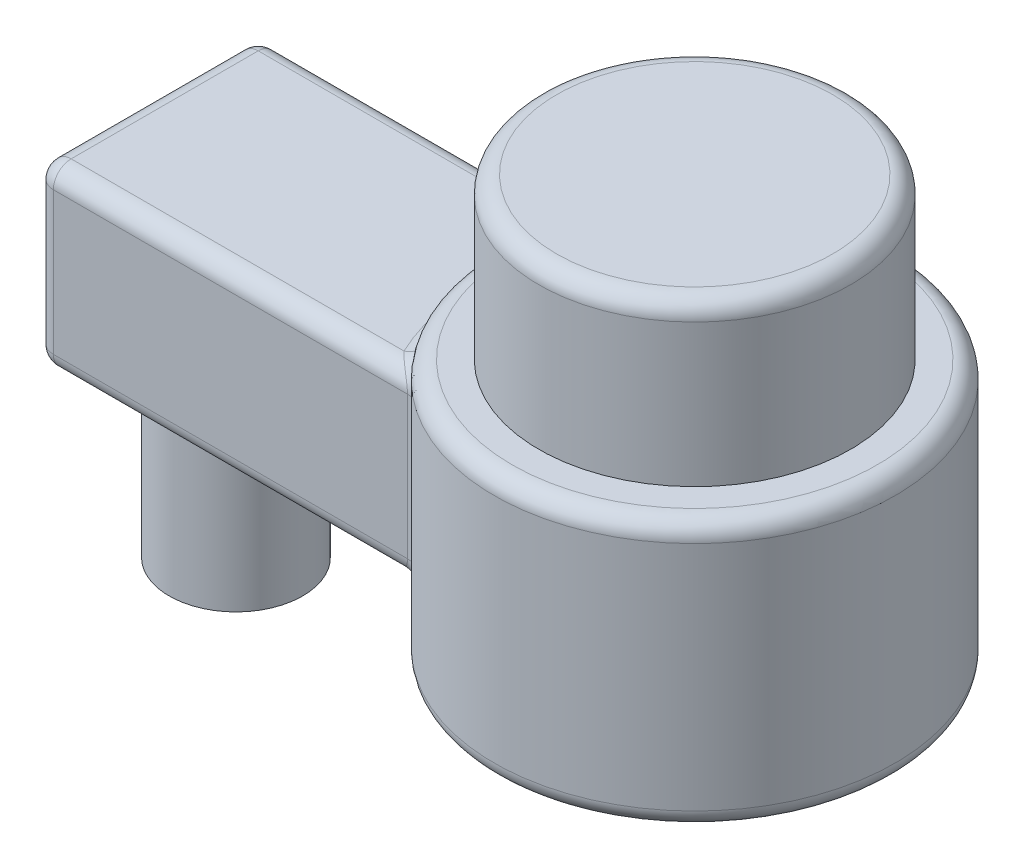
ISO-10303-21;
HEADER;
FILE_DESCRIPTION(('STEP AP214'),'2;1');
FILE_NAME('part.step','',(''),(''),'','','');
FILE_SCHEMA(('AUTOMOTIVE_DESIGN { 1 0 10303 214 1 1 1 1 }'));
ENDSEC;
DATA;
#1=APPLICATION_CONTEXT('core data for automotive mechanical design processes');
#2=APPLICATION_PROTOCOL_DEFINITION('international standard','automotive_design',2000,#1);
#3=PRODUCT_CONTEXT('',#1,'mechanical');
#4=PRODUCT('Part','Part','',(#3));
#5=PRODUCT_RELATED_PRODUCT_CATEGORY('part','',(#4));
#6=PRODUCT_DEFINITION_FORMATION('','',#4);
#7=PRODUCT_DEFINITION_CONTEXT('part definition',#1,'design');
#8=PRODUCT_DEFINITION('design','',#6,#7);
#9=PRODUCT_DEFINITION_SHAPE('','',#8);
#10=(LENGTH_UNIT() NAMED_UNIT(*) SI_UNIT(.MILLI.,.METRE.));
#11=(NAMED_UNIT(*) PLANE_ANGLE_UNIT() SI_UNIT($,.RADIAN.));
#12=(NAMED_UNIT(*) SI_UNIT($,.STERADIAN.) SOLID_ANGLE_UNIT());
#13=UNCERTAINTY_MEASURE_WITH_UNIT(LENGTH_MEASURE(1.E-05),#10,'distance_accuracy_value','');
#14=(GEOMETRIC_REPRESENTATION_CONTEXT(3) GLOBAL_UNCERTAINTY_ASSIGNED_CONTEXT((#13)) GLOBAL_UNIT_ASSIGNED_CONTEXT((#10,
#11,#12)) REPRESENTATION_CONTEXT('',''));
#15=CARTESIAN_POINT('',(0.,0.,0.));
#16=DIRECTION('',(0.,0.,1.));
#17=DIRECTION('',(1.,0.,0.));
#18=AXIS2_PLACEMENT_3D('',#15,#16,#17);
#19=CARTESIAN_POINT('',(-15.6488353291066,5.,-12.5));
#20=DIRECTION('',(0.,-1.,0.));
#21=DIRECTION('',(0.,0.,-1.));
#22=AXIS2_PLACEMENT_3D('',#19,#20,#21);
#23=PLANE('',#22);
#24=CARTESIAN_POINT('',(0.,5.,0.));
#25=DIRECTION('',(0.,-1.,0.));
#26=DIRECTION('',(0.,0.,-1.));
#27=AXIS2_PLACEMENT_3D('',#24,#25,#26);
#28=CIRCLE('',#27,24.5);
#29=CARTESIAN_POINT('',(-22.1359436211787,5.,-10.5));
#30=VERTEX_POINT('',#29);
#31=CARTESIAN_POINT('',(-22.1359436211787,5.,10.5));
#32=VERTEX_POINT('',#31);
#33=EDGE_CURVE('E455',#30,#32,#28,.F.);
#34=ORIENTED_EDGE('',*,*,#33,.T.);
#35=DIRECTION('',(1.,0.,0.));
#36=VECTOR('',#35,1.);
#37=CARTESIAN_POINT('',(-61.5,5.,10.5));
#38=LINE('',#37,#36);
#39=CARTESIAN_POINT('',(-59.5,5.,10.5));
#40=VERTEX_POINT('',#39);
#41=EDGE_CURVE('E510',#32,#40,#38,.F.);
#42=ORIENTED_EDGE('',*,*,#41,.T.);
#43=DIRECTION('',(0.,0.,1.));
#44=VECTOR('',#43,1.);
#45=CARTESIAN_POINT('',(-59.5,5.,-12.5));
#46=LINE('',#45,#44);
#47=CARTESIAN_POINT('',(-59.5,5.,-10.5));
#48=VERTEX_POINT('',#47);
#49=EDGE_CURVE('E530',#40,#48,#46,.F.);
#50=ORIENTED_EDGE('',*,*,#49,.T.);
#51=DIRECTION('',(-1.,0.,0.));
#52=VECTOR('',#51,1.);
#53=CARTESIAN_POINT('',(-18.7082869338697,5.,-10.5));
#54=LINE('',#53,#52);
#55=EDGE_CURVE('E773',#48,#30,#54,.F.);
#56=ORIENTED_EDGE('',*,*,#55,.T.);
#57=EDGE_LOOP('',(#34,#42,#50,#56));
#58=FACE_BOUND('',#57,.T.);
#59=CARTESIAN_POINT('',(-51.5,5.,0.));
#60=DIRECTION('',(0.,-1.,0.));
#61=DIRECTION('',(0.,0.,-1.));
#62=AXIS2_PLACEMENT_3D('',#59,#60,#61);
#63=CIRCLE('',#62,7.5);
#64=CARTESIAN_POINT('',(-51.5,5.,-7.5));
#65=VERTEX_POINT('',#64);
#66=EDGE_CURVE('E752',#65,#65,#63,.T.);
#67=ORIENTED_EDGE('',*,*,#66,.F.);
#68=EDGE_LOOP('',(#67));
#69=FACE_BOUND('',#68,.T.);
#70=ADVANCED_FACE('F30',(#58,#69),#23,.T.);
#71=CARTESIAN_POINT('',(0.,0.,0.));
#72=DIRECTION('',(0.,-1.,0.));
#73=DIRECTION('',(0.,0.,-1.));
#74=AXIS2_PLACEMENT_3D('',#71,#72,#73);
#75=CYLINDRICAL_SURFACE('',#74,22.5);
#76=CARTESIAN_POINT('',(-20.879488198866,26.757926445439,8.3843289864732));
#77=CARTESIAN_POINT('',(-20.6078715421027,24.6039792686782,9.06073574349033));
#78=CARTESIAN_POINT('',(-22.7354427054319,24.8789632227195,9.81480133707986));
#79=CARTESIAN_POINT('',(-20.8382865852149,26.7986754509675,8.48694754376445));
#80=CARTESIAN_POINT('',(-20.5888753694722,24.6429935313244,9.098457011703));
#81=CARTESIAN_POINT('',(-22.6905787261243,24.8993377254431,9.87067144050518));
#82=CARTESIAN_POINT('',(-20.7957419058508,26.834221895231,8.59069223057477));
#83=CARTESIAN_POINT('',(-20.5688686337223,24.6812606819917,9.13906664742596));
#84=CARTESIAN_POINT('',(-22.6442522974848,24.9171109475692,9.92715465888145));
#85=CARTESIAN_POINT('',(-20.7081981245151,26.8949689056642,8.79962007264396));
#86=CARTESIAN_POINT('',(-20.5267565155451,24.7549711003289,9.22580997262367));
#87=CARTESIAN_POINT('',(-22.5489268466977,24.9474844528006,10.040904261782));
#88=CARTESIAN_POINT('',(-20.6632004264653,26.9201753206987,8.90480237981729));
#89=CARTESIAN_POINT('',(-20.5046929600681,24.790414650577,9.27184391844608));
#90=CARTESIAN_POINT('',(-22.4999293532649,24.9600876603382,10.0981701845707));
#91=CARTESIAN_POINT('',(-20.52511683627,26.9802967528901,9.22074414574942));
#92=CARTESIAN_POINT('',(-20.4356053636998,24.8904745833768,9.41703276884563));
#93=CARTESIAN_POINT('',(-22.3495716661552,24.9901483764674,10.2701829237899));
#94=CARTESIAN_POINT('',(-20.4286570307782,26.9999900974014,9.43260746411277));
#95=CARTESIAN_POINT('',(-20.3850267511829,24.9503409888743,9.5246024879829));
#96=CARTESIAN_POINT('',(-22.2445376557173,24.999995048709,10.3855307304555));
#97=CARTESIAN_POINT('',(-20.2183674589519,27.0000109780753,9.87594109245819));
#98=CARTESIAN_POINT('',(-20.2683229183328,25.0536477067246,9.77061021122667));
#99=CARTESIAN_POINT('',(-22.0155556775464,25.0000054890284,10.626901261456));
#100=CARTESIAN_POINT('',(-20.1037889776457,26.9758308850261,10.1070418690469));
#101=CARTESIAN_POINT('',(-20.2013697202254,25.0952998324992,9.91063460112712));
#102=CARTESIAN_POINT('',(-21.8907924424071,24.9879154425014,10.752722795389));
#103=CARTESIAN_POINT('',(-19.8700898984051,26.8816894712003,10.559090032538));
#104=CARTESIAN_POINT('',(-20.0567626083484,25.1448495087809,10.2054645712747));
#105=CARTESIAN_POINT('',(-21.6363201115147,24.9408447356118,10.998837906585));
#106=CARTESIAN_POINT('',(-19.7509645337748,26.8116787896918,10.7800261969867));
#107=CARTESIAN_POINT('',(-19.9794522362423,25.1536012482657,10.3597524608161));
#108=CARTESIAN_POINT('',(-21.506605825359,24.9058393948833,11.1191253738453));
#109=CARTESIAN_POINT('',(-19.5125860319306,26.6284901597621,11.2057327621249));
#110=CARTESIAN_POINT('',(-19.8175469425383,25.1330370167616,10.6730154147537));
#111=CARTESIAN_POINT('',(-21.2470381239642,24.8142450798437,11.3508989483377));
#112=CARTESIAN_POINT('',(-19.3933332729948,26.515369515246,11.410524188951));
#113=CARTESIAN_POINT('',(-19.7331338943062,25.1047654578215,10.8318972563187));
#114=CARTESIAN_POINT('',(-21.1171851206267,24.7576847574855,11.4623965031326));
#115=CARTESIAN_POINT('',(-19.1593277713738,26.2479788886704,11.7992221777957));
#116=CARTESIAN_POINT('',(-19.5618090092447,25.0084836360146,11.1445274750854));
#117=CARTESIAN_POINT('',(-20.8623791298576,24.6239894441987,11.6740209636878));
#118=CARTESIAN_POINT('',(-19.0445770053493,26.0936910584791,11.9831196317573));
#119=CARTESIAN_POINT('',(-19.4748307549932,24.9413559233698,11.2986296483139));
#120=CARTESIAN_POINT('',(-20.7374282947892,24.5468455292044,11.7741429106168));
#121=CARTESIAN_POINT('',(-18.8255594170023,25.7457944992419,12.3243435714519));
#122=CARTESIAN_POINT('',(-19.3048988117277,24.7676242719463,11.5914109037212));
#123=CARTESIAN_POINT('',(-20.4989424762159,24.3728972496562,11.9599203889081));
#124=CARTESIAN_POINT('',(-18.7212991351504,25.5521614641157,12.4816535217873));
#125=CARTESIAN_POINT('',(-19.2216375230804,24.6616234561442,11.7307986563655));
#126=CARTESIAN_POINT('',(-20.3854146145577,24.2760807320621,12.0455669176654));
#127=CARTESIAN_POINT('',(-18.5311386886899,25.1284405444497,12.7622739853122));
#128=CARTESIAN_POINT('',(-19.0676093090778,24.4127232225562,11.9828852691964));
#129=CARTESIAN_POINT('',(-20.1783510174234,24.0642202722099,12.1983491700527));
#130=CARTESIAN_POINT('',(-18.4451976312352,24.8984358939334,12.8856604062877));
#131=CARTESIAN_POINT('',(-18.9963052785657,24.2701016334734,12.0965884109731));
#132=CARTESIAN_POINT('',(-20.0847707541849,23.9492179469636,12.2655262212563));
#133=CARTESIAN_POINT('',(-18.3229898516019,24.4837460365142,13.0585453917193));
#134=CARTESIAN_POINT('',(-18.8941254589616,24.0029480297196,12.2570732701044));
#135=CARTESIAN_POINT('',(-19.9517000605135,23.7418730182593,12.359652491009));
#136=CARTESIAN_POINT('',(-18.27957787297,24.3069719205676,13.1190953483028));
#137=CARTESIAN_POINT('',(-18.8574603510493,23.8866193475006,12.3138600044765));
#138=CARTESIAN_POINT('',(-19.9044292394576,23.653485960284,12.3926185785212));
#139=CARTESIAN_POINT('',(-18.2088149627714,23.9424970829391,13.2171380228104));
#140=CARTESIAN_POINT('',(-18.7976038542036,23.6433928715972,12.4059414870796));
#141=CARTESIAN_POINT('',(-19.8273762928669,23.4712485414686,12.4459973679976));
#142=CARTESIAN_POINT('',(-18.1814390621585,23.7548138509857,13.2546665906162));
#143=CARTESIAN_POINT('',(-18.7742206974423,23.5162283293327,12.4415372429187));
#144=CARTESIAN_POINT('',(-19.7975669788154,23.3774069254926,12.4664295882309));
#145=CARTESIAN_POINT('',(-18.1448961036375,23.372698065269,13.3046514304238));
#146=CARTESIAN_POINT('',(-18.7430637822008,23.2558683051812,12.4888599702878));
#147=CARTESIAN_POINT('',(-19.7577757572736,23.1863490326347,12.4936435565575));
#148=CARTESIAN_POINT('',(-18.1357958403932,23.1782433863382,13.317015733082));
#149=CARTESIAN_POINT('',(-18.7352455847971,23.1222450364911,12.5006543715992));
#150=CARTESIAN_POINT('',(-19.7478665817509,23.0891216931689,12.5003752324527));
#151=CARTESIAN_POINT('',(-18.136852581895,22.7892385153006,13.3155766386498));
#152=CARTESIAN_POINT('',(-18.7361491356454,22.8554385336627,12.4992879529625));
#153=CARTESIAN_POINT('',(-19.7490172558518,22.8946192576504,12.4995917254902));
#154=CARTESIAN_POINT('',(-18.1470373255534,22.5946885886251,13.3017355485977));
#155=CARTESIAN_POINT('',(-18.7448978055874,22.7218033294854,12.4860865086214));
#156=CARTESIAN_POINT('',(-19.7601073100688,22.7973442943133,12.4920560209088));
#157=CARTESIAN_POINT('',(-18.1845552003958,22.2240336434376,13.2503904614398));
#158=CARTESIAN_POINT('',(-18.7768721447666,22.4694763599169,12.4374974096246));
#159=CARTESIAN_POINT('',(-19.8009601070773,22.6120168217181,12.4641014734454));
#160=CARTESIAN_POINT('',(-18.2107707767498,22.0475377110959,13.21442772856));
#161=CARTESIAN_POINT('',(-18.7992476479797,22.3500044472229,12.4034125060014));
#162=CARTESIAN_POINT('',(-19.8295059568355,22.5237688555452,12.4445217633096));
#163=CARTESIAN_POINT('',(-18.2606574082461,21.7904266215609,13.1453100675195));
#164=CARTESIAN_POINT('',(-18.8413817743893,22.1786772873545,12.3385949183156));
#165=CARTESIAN_POINT('',(-19.8838269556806,22.3952133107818,12.4068910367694));
#166=CARTESIAN_POINT('',(-18.2790383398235,21.7060239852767,13.119753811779));
#167=CARTESIAN_POINT('',(-18.8569050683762,22.1227280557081,12.3146296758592));
#168=CARTESIAN_POINT('',(-19.9038417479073,22.3530119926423,12.3929770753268));
#169=CARTESIAN_POINT('',(-18.3190158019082,21.5400813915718,13.0638752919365));
#170=CARTESIAN_POINT('',(-18.8905308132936,22.0136606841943,12.2624467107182));
#171=CARTESIAN_POINT('',(-19.9473727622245,22.2700406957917,12.3625543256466));
#172=CARTESIAN_POINT('',(-18.3406108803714,21.458540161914,13.0335551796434));
#173=CARTESIAN_POINT('',(-18.9086516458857,21.9605184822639,12.2341996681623));
#174=CARTESIAN_POINT('',(-19.9708874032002,22.2292700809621,12.3460467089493));
#175=CARTESIAN_POINT('',(-18.3636693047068,21.3785626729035,13.0009864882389));
#176=CARTESIAN_POINT('',(-18.9278729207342,21.9090613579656,12.2040586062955));
#177=CARTESIAN_POINT('',(-19.9959954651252,22.1892813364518,12.328314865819));
#178=(BOUNDED_SURFACE() B_SPLINE_SURFACE(3,2,((#76,#77,#78),(#79,#80,#81),(#82,#83,#84),(#85,
#86,#87),(#88,#89,#90),(#91,#92,#93),(#94,#95,#96),(#97,#98,#99),(#100,#101,#102),(#103,#104,
#105),(#106,#107,#108),(#109,#110,#111),(#112,#113,#114),(#115,#116,#117),(#118,#119,#120),
(#121,#122,#123),(#124,#125,#126),(#127,#128,#129),(#130,#131,#132),(#133,#134,#135),(#136,#137,
#138),(#139,#140,#141),(#142,#143,#144),(#145,#146,#147),(#148,#149,#150),(#151,#152,#153),
(#154,#155,#156),(#157,#158,#159),(#160,#161,#162),(#163,#164,#165),(#166,#167,#168),(#169,#170,
#171),(#172,#173,#174),(#175,#176,#177)),.UNSPECIFIED.,.F.,.F.,
.F.) B_SPLINE_SURFACE_WITH_KNOTS((4,2,2,2,2,2,2,2,2,2,2,2,2,2,2,2,4),(3,3),(0.,
0.381101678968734,0.761987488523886,1.521164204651,2.36279168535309,3.20532711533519,
4.04674648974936,4.88853125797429,5.7308376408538,6.57124363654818,7.15236629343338,
7.73258168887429,8.31491385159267,8.89808425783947,9.44461671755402,9.71768700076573,
9.99063429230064),(0.,1.),
.UNSPECIFIED.) GEOMETRIC_REPRESENTATION_ITEM() RATIONAL_B_SPLINE_SURFACE(((1.,0.660429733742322,
1.),(1.,0.663777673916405,1.),(1.,0.667283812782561,1.),(1.,0.674581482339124,1.),(1.,
0.678372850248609,1.),(1.,0.690107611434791,1.),(1.,0.698434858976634,1.),(1.,0.716720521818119,
1.),(1.,0.726757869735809,1.),(1.,0.747208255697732,1.),(1.,0.757621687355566,1.),(1.,
0.778316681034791,1.),(1.,0.78859839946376,1.),(1.,0.808571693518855,1.),(1.,0.81826301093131,
1.),(1.,0.836555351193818,1.),(1.,0.845155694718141,1.),(1.,0.860681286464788,1.),(1.,
0.867610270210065,1.),(1.,0.877389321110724,1.),(1.,0.880838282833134,1.),(1.,0.886440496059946,
1.),(1.,0.888595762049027,1.),(1.,0.891469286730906,1.),(1.,0.892182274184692,1.),(1.,
0.89209937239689,1.),(1.,0.891301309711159,1.),(1.,0.888350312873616,1.),(1.,0.886285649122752,
1.),(1.,0.882336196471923,1.),(1.,0.880878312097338,1.),(1.,0.877698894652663,1.),(1.,
0.87597748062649,1.),(1.,0.874133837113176,1.))) REPRESENTATION_ITEM('') SURFACE());
#179=CARTESIAN_POINT('',(-18.3636693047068,21.3785626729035,13.0009864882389));
#180=CARTESIAN_POINT('',(-18.3406108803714,21.458540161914,13.0335551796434));
#181=CARTESIAN_POINT('',(-18.3190158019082,21.5400813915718,13.0638752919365));
#182=CARTESIAN_POINT('',(-18.2790383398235,21.7060239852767,13.119753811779));
#183=CARTESIAN_POINT('',(-18.2606574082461,21.7904266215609,13.1453100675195));
#184=CARTESIAN_POINT('',(-18.2107707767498,22.0475377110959,13.21442772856));
#185=CARTESIAN_POINT('',(-18.1845552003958,22.2240336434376,13.2503904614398));
#186=CARTESIAN_POINT('',(-18.1470373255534,22.5946885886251,13.3017355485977));
#187=CARTESIAN_POINT('',(-18.136852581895,22.7892385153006,13.3155766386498));
#188=CARTESIAN_POINT('',(-18.1357958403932,23.1782433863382,13.3170157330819));
#189=CARTESIAN_POINT('',(-18.1448961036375,23.372698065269,13.3046514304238));
#190=CARTESIAN_POINT('',(-18.1814390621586,23.7548138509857,13.2546665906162));
#191=CARTESIAN_POINT('',(-18.2088149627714,23.9424970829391,13.2171380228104));
#192=CARTESIAN_POINT('',(-18.27957787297,24.3069719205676,13.1190953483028));
#193=CARTESIAN_POINT('',(-18.3229898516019,24.4837460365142,13.0585453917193));
#194=CARTESIAN_POINT('',(-18.4451976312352,24.8984358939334,12.8856604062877));
#195=CARTESIAN_POINT('',(-18.5311386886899,25.1284405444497,12.7622739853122));
#196=CARTESIAN_POINT('',(-18.7212991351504,25.5521614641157,12.4816535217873));
#197=CARTESIAN_POINT('',(-18.8255594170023,25.7457944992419,12.3243435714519));
#198=CARTESIAN_POINT('',(-19.0445770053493,26.0936910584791,11.9831196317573));
#199=CARTESIAN_POINT('',(-19.1593277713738,26.2479788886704,11.7992221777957));
#200=CARTESIAN_POINT('',(-19.3933332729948,26.515369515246,11.410524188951));
#201=CARTESIAN_POINT('',(-19.5125860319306,26.6284901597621,11.2057327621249));
#202=CARTESIAN_POINT('',(-19.7509645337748,26.8116787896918,10.7800261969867));
#203=CARTESIAN_POINT('',(-19.8700898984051,26.8816894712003,10.559090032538));
#204=CARTESIAN_POINT('',(-20.1037889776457,26.9758308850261,10.1070418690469));
#205=CARTESIAN_POINT('',(-20.2183674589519,27.0000109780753,9.87594109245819));
#206=CARTESIAN_POINT('',(-20.4286570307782,26.9999900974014,9.43260746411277));
#207=CARTESIAN_POINT('',(-20.52511683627,26.9802967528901,9.22074414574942));
#208=CARTESIAN_POINT('',(-20.6632004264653,26.9201753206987,8.90480237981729));
#209=CARTESIAN_POINT('',(-20.7081981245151,26.8949689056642,8.79962007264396));
#210=CARTESIAN_POINT('',(-20.7957419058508,26.834221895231,8.59069223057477));
#211=CARTESIAN_POINT('',(-20.8382865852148,26.7986754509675,8.48694754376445));
#212=CARTESIAN_POINT('',(-20.879488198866,26.757926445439,8.3843289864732));
#213=B_SPLINE_CURVE_WITH_KNOTS('',3,(#179,#180,#181,#182,#183,#184,#185,#186,#187,#188,#189,
#190,#191,#192,#193,#194,#195,#196,#197,#198,#199,#200,#201,#202,#203,#204,#205,#206,#207,#208,
#209,#210,#211,#212),.UNSPECIFIED.,.F.,.F.,(4,2,2,2,2,2,2,2,2,2,2,2,2,2,2,2,4),(0.,
0.272947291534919,0.546017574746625,1.09255003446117,1.67572044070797,2.25805260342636,
2.83826799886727,3.41939065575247,4.25979665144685,5.10210303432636,5.94388780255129,
6.78530717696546,7.62784260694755,8.46947008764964,9.22864680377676,9.60953261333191,
9.99063429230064),.UNSPECIFIED.);
#214=CARTESIAN_POINT('',(-18.1363019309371,23.,13.3163265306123));
#215=VERTEX_POINT('',#214);
#216=CARTESIAN_POINT('',(-20.3289278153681,27.,9.64285714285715));
#217=VERTEX_POINT('',#216);
#218=EDGE_CURVE('E332',#215,#217,#213,.T.);
#219=ORIENTED_EDGE('',*,*,#218,.F.);
#220=DIRECTION('',(0.,-1.,0.));
#221=VECTOR('',#220,1.);
#222=CARTESIAN_POINT('',(-18.1363019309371,0.,13.3163265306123));
#223=LINE('',#222,#221);
#224=CARTESIAN_POINT('',(-18.1363019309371,7.,13.3163265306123));
#225=VERTEX_POINT('',#224);
#226=EDGE_CURVE('E543',#215,#225,#223,.T.);
#227=ORIENTED_EDGE('',*,*,#226,.T.);
#228=CARTESIAN_POINT('',(-18.244886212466,8.12828022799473,13.167160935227));
#229=CARTESIAN_POINT('',(-18.8280207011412,7.76698640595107,12.3591490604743));
#230=CARTESIAN_POINT('',(-19.8666538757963,7.56414011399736,12.4187876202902));
#231=CARTESIAN_POINT('',(-18.2272728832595,8.03796188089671,13.1915616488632));
#232=CARTESIAN_POINT('',(-18.8131412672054,7.70683506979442,12.3820375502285));
#233=CARTESIAN_POINT('',(-19.8474749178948,7.5189809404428,12.4320724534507));
#234=CARTESIAN_POINT('',(-18.2116389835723,7.94626021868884,13.2131260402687));
#235=CARTESIAN_POINT('',(-18.7998721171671,7.64519775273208,12.4023598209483));
#236=CARTESIAN_POINT('',(-19.8304513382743,7.47313010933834,12.4438130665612));
#237=CARTESIAN_POINT('',(-18.1845840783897,7.76069701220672,13.2503383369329));
#238=CARTESIAN_POINT('',(-18.776883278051,7.51985878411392,12.4374687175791));
#239=CARTESIAN_POINT('',(-19.8009915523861,7.38034850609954,12.4640730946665));
#240=CARTESIAN_POINT('',(-18.1731642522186,7.66683487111,13.2659845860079));
#241=CARTESIAN_POINT('',(-18.7671473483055,7.456114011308,12.4522803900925));
#242=CARTESIAN_POINT('',(-19.7885566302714,7.33341743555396,12.4725916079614));
#243=CARTESIAN_POINT('',(-18.1548243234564,7.47784213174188,13.2910718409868));
#244=CARTESIAN_POINT('',(-18.7515093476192,7.32736174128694,12.4760327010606));
#245=CARTESIAN_POINT('',(-19.7685864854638,7.23892106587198,12.4862502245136));
#246=CARTESIAN_POINT('',(-18.1478931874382,7.38271523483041,13.3005280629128));
#247=CARTESIAN_POINT('',(-18.745585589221,7.26230946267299,12.4850064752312));
#248=CARTESIAN_POINT('',(-19.7610392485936,7.19135761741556,12.4913986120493));
#249=CARTESIAN_POINT('',(-18.1386285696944,7.19174401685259,13.3131589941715));
#250=CARTESIAN_POINT('',(-18.7376691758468,7.13154289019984,12.4969904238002));
#251=CARTESIAN_POINT('',(-19.7509511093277,7.09587200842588,12.4982754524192));
#252=CARTESIAN_POINT('',(-18.1362944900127,7.0958997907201,13.3163345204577));
#253=CARTESIAN_POINT('',(-18.7356696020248,7.06577629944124,12.5000110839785));
#254=CARTESIAN_POINT('',(-19.7484095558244,7.04794989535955,12.5000043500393));
#255=CARTESIAN_POINT('',(-18.1363171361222,6.80403321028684,13.3163102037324));
#256=CARTESIAN_POINT('',(-18.7356960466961,6.86558893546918,12.4999773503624));
#257=CARTESIAN_POINT('',(-19.7484342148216,6.90201660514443,12.4999911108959));
#258=CARTESIAN_POINT('',(-18.1461098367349,6.60783439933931,13.3030004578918));
#259=CARTESIAN_POINT('',(-18.7441052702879,6.73079309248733,12.4872866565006));
#260=CARTESIAN_POINT('',(-19.7590973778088,6.80391719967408,12.4927446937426));
#261=CARTESIAN_POINT('',(-18.1843779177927,6.22202650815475,13.2506369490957));
#262=CARTESIAN_POINT('',(-18.7767247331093,6.46804747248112,12.4377250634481));
#263=CARTESIAN_POINT('',(-19.8007670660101,6.61101325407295,12.4642356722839));
#264=CARTESIAN_POINT('',(-18.2128502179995,6.03241634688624,13.2115874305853));
#265=CARTESIAN_POINT('',(-18.8010403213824,6.33968239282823,12.4006935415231));
#266=CARTESIAN_POINT('',(-19.8317702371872,6.51620817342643,12.4429753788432));
#267=CARTESIAN_POINT('',(-18.2858489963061,5.66569144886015,13.1103607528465));
#268=CARTESIAN_POINT('',(-18.8627519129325,6.0953192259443,12.3056753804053));
#269=CARTESIAN_POINT('',(-19.9112577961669,6.33284572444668,12.3878630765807));
#270=CARTESIAN_POINT('',(-18.3302965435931,5.48852030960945,13.0482972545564));
#271=CARTESIAN_POINT('',(-18.9002623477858,5.97897478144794,12.2475111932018));
#272=CARTESIAN_POINT('',(-19.9596562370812,6.24426015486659,12.3540729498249));
#273=CARTESIAN_POINT('',(-18.4322269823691,5.1490458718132,12.9039061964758));
#274=CARTESIAN_POINT('',(-18.9852435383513,5.76123938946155,12.1138726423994));
#275=CARTESIAN_POINT('',(-20.0706471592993,6.07452293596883,12.2754600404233));
#276=CARTESIAN_POINT('',(-18.4897197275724,4.98675394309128,12.8215633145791));
#277=CARTESIAN_POINT('',(-19.0329229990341,5.65972731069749,12.0380532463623));
#278=CARTESIAN_POINT('',(-20.1332503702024,5.9933769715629,12.2306289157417));
#279=CARTESIAN_POINT('',(-18.6199715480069,4.66606914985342,12.6317448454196));
#280=CARTESIAN_POINT('',(-19.13944617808,5.46568283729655,11.8658170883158));
#281=CARTESIAN_POINT('',(-20.2750801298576,5.83303457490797,12.1272833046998));
#282=CARTESIAN_POINT('',(-18.6936154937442,4.50919538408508,12.5227225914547));
#283=CARTESIAN_POINT('',(-19.1990675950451,5.37477943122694,11.7678783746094));
#284=CARTESIAN_POINT('',(-20.3552702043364,5.75459769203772,12.0679267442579));
#285=CARTESIAN_POINT('',(-18.8490875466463,4.21697328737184,12.2874658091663));
#286=CARTESIAN_POINT('',(-19.3226017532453,5.21427043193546,11.5607873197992));
#287=CARTESIAN_POINT('',(-20.5245619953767,5.60848664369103,11.9398424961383));
#288=CARTESIAN_POINT('',(-18.9309231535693,4.08164498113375,12.1612154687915));
#289=CARTESIAN_POINT('',(-19.3867001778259,5.1448658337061,11.4512575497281));
#290=CARTESIAN_POINT('',(-20.6136718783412,5.540822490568,11.8711061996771));
#291=CARTESIAN_POINT('',(-19.1152282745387,3.81082736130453,11.8698305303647));
#292=CARTESIAN_POINT('',(-19.5281234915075,5.01696481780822,11.204273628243));
#293=CARTESIAN_POINT('',(-20.8143596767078,5.40541368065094,11.712463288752));
#294=CARTESIAN_POINT('',(-19.2187322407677,3.67984567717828,11.7018088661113));
#295=CARTESIAN_POINT('',(-19.6056251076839,4.96349836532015,11.0654158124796));
#296=CARTESIAN_POINT('',(-20.9270639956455,5.33992283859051,11.6209848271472));
#297=CARTESIAN_POINT('',(-19.4288968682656,3.45081472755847,11.3494549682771));
#298=CARTESIAN_POINT('',(-19.7581070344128,4.88672609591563,10.7849525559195));
#299=CARTESIAN_POINT('',(-21.1559099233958,5.22540736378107,11.4291477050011));
#300=CARTESIAN_POINT('',(-19.5355602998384,3.35279535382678,11.1651081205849));
#301=CARTESIAN_POINT('',(-19.833106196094,4.86410749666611,10.6431343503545));
#302=CARTESIAN_POINT('',(-21.2720545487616,5.17639767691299,11.328781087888));
#303=CARTESIAN_POINT('',(-19.7611921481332,3.18176079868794,10.7612663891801));
#304=CARTESIAN_POINT('',(-19.9861814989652,4.84665049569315,10.3464503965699));
#305=CARTESIAN_POINT('',(-21.5177425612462,5.09088039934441,11.1089117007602));
#306=CARTESIAN_POINT('',(-19.8801234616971,3.11307553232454,10.540193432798));
#307=CARTESIAN_POINT('',(-20.0631632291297,4.85638574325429,10.1925854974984));
#308=CARTESIAN_POINT('',(-21.6472455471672,5.05653776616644,10.9885497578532));
#309=CARTESIAN_POINT('',(-20.1134118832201,3.02158825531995,10.0878731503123));
#310=CARTESIAN_POINT('',(-20.2071021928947,4.90773586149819,9.89875422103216));
#311=CARTESIAN_POINT('',(-21.9012707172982,5.01079412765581,10.7422864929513));
#312=CARTESIAN_POINT('',(-20.2277727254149,2.99874800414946,9.85663446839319));
#313=CARTESIAN_POINT('',(-20.2737106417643,4.9502061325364,9.75931841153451));
#314=CARTESIAN_POINT('',(-22.025796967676,4.99937400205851,10.6163898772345));
#315=CARTESIAN_POINT('',(-20.3930057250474,3.00070623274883,9.50747283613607));
#316=CARTESIAN_POINT('',(-20.3646415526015,5.03214291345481,9.56753504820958));
#317=CARTESIAN_POINT('',(-22.2057173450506,5.00035311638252,10.4262907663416));
#318=CARTESIAN_POINT('',(-20.447010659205,3.00738501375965,9.39075118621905));
#319=CARTESIAN_POINT('',(-20.3936663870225,5.06285956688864,9.50604578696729));
#320=CARTESIAN_POINT('',(-22.2645227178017,5.00369250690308,10.3627423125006));
#321=CARTESIAN_POINT('',(-20.552606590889,3.0330375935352,9.15733187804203));
#322=CARTESIAN_POINT('',(-20.4489873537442,5.12959377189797,9.38903189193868));
#323=CARTESIAN_POINT('',(-22.3795049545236,5.01651879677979,10.2356584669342));
#324=CARTESIAN_POINT('',(-20.6041979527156,3.05200953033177,9.04063421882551));
#325=CARTESIAN_POINT('',(-20.4752260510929,5.1656548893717,9.33363127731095));
#326=CARTESIAN_POINT('',(-22.4356822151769,5.02600476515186,10.1721230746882));
#327=CARTESIAN_POINT('',(-20.7047784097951,3.10255653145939,8.80785232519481));
#328=CARTESIAN_POINT('',(-20.5251929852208,5.24207432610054,9.22905728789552));
#329=CARTESIAN_POINT('',(-22.5452031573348,5.05127826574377,10.0453862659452));
#330=CARTESIAN_POINT('',(-20.7537563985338,3.13418117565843,8.69177234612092));
#331=CARTESIAN_POINT('',(-20.5488521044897,5.28246321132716,9.18004486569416));
#332=CARTESIAN_POINT('',(-22.5985347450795,5.06709058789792,9.98218716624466));
#333=CARTESIAN_POINT('',(-20.8485992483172,3.2101205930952,8.46176970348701));
#334=CARTESIAN_POINT('',(-20.5937884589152,5.3663125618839,9.0885434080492));
#335=CARTESIAN_POINT('',(-22.7018080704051,5.10506029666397,9.85696350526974));
#336=CARTESIAN_POINT('',(-20.894461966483,3.25444399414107,8.34784856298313));
#337=CARTESIAN_POINT('',(-20.6150103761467,5.40976440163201,9.04618807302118));
#338=CARTESIAN_POINT('',(-22.7517474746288,5.12722199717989,9.79493977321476));
#339=CARTESIAN_POINT('',(-20.9385883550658,3.305139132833,8.23562491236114));
#340=CARTESIAN_POINT('',(-20.6350526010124,5.45385842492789,9.00734658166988));
#341=CARTESIAN_POINT('',(-22.7997962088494,5.1525695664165,9.73384023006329));
#342=(BOUNDED_SURFACE() B_SPLINE_SURFACE(3,2,((#228,#229,#230),(#231,#232,#233),(#234,#235,
#236),(#237,#238,#239),(#240,#241,#242),(#243,#244,#245),(#246,#247,#248),(#249,#250,#251),
(#252,#253,#254),(#255,#256,#257),(#258,#259,#260),(#261,#262,#263),(#264,#265,#266),(#267,#268,
#269),(#270,#271,#272),(#273,#274,#275),(#276,#277,#278),(#279,#280,#281),(#282,#283,#284),
(#285,#286,#287),(#288,#289,#290),(#291,#292,#293),(#294,#295,#296),(#297,#298,#299),(#300,#301,
#302),(#303,#304,#305),(#306,#307,#308),(#309,#310,#311),(#312,#313,#314),(#315,#316,#317),
(#318,#319,#320),(#321,#322,#323),(#324,#325,#326),(#327,#328,#329),(#330,#331,#332),(#333,#334,
#335),(#336,#337,#338),(#339,#340,#341)),.UNSPECIFIED.,.F.,.F.,
.F.) B_SPLINE_SURFACE_WITH_KNOTS((4,2,2,2,2,2,2,2,2,2,2,2,2,2,2,2,2,2,4),(3,3),(0.,
0.288176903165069,0.576434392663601,0.863980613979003,1.15148943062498,1.73900040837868,
2.32641453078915,2.91096536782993,3.49595922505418,4.13095774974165,4.76654305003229,
5.51850589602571,6.27114882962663,7.11283174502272,7.95381229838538,8.37394988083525,
8.79402384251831,9.21576025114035,9.63778387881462),(0.,1.),
.UNSPECIFIED.) GEOMETRIC_REPRESENTATION_ITEM() RATIONAL_B_SPLINE_SURFACE(((1.,0.883584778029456,
1.),(1.,0.884979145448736,1.),(1.,0.886213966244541,1.),(1.,0.888347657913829,1.),(1.,
0.889246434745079,1.),(1.,0.890688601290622,1.),(1.,0.891232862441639,1.),(1.,0.891960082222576,
1.),(1.,0.892143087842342,1.),(1.,0.892141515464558,1.),(1.,0.891374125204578,1.),(1.,
0.888364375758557,1.),(1.,0.88612225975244,1.),(1.,0.880340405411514,1.),(1.,0.876807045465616,
1.),(1.,0.868645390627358,1.),(1.,0.864016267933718,1.),(1.,0.853442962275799,1.),(1.,
0.847420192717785,1.),(1.,0.834586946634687,1.),(1.,0.827775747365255,1.),(1.,0.812297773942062,
1.),(1.,0.80351959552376,1.),(1.,0.785533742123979,1.),(1.,0.776325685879,1.),(1.,
0.756729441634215,1.),(1.,0.746330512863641,1.),(1.,0.725915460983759,1.),(1.,0.715899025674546,
1.),(1.,0.701536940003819,1.),(1.,0.696861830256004,1.),(1.,0.687780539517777,1.),(1.,
0.683374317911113,1.),(1.,0.674866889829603,1.),(1.,0.670766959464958,1.),(1.,0.662930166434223,
1.),(1.,0.659193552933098,1.),(1.,0.655660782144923,1.))) REPRESENTATION_ITEM('') SURFACE());
#343=CARTESIAN_POINT('',(-20.9385883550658,3.305139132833,8.23562491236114));
#344=CARTESIAN_POINT('',(-20.894461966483,3.25444399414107,8.34784856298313));
#345=CARTESIAN_POINT('',(-20.8485992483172,3.2101205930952,8.46176970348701));
#346=CARTESIAN_POINT('',(-20.7537563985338,3.13418117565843,8.69177234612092));
#347=CARTESIAN_POINT('',(-20.7047784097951,3.10255653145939,8.80785232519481));
#348=CARTESIAN_POINT('',(-20.6041979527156,3.05200953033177,9.04063421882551));
#349=CARTESIAN_POINT('',(-20.552606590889,3.0330375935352,9.15733187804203));
#350=CARTESIAN_POINT('',(-20.447010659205,3.00738501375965,9.39075118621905));
#351=CARTESIAN_POINT('',(-20.3930057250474,3.00070623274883,9.50747283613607));
#352=CARTESIAN_POINT('',(-20.2277727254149,2.99874800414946,9.85663446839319));
#353=CARTESIAN_POINT('',(-20.1134118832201,3.02158825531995,10.0878731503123));
#354=CARTESIAN_POINT('',(-19.8801234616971,3.11307553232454,10.540193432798));
#355=CARTESIAN_POINT('',(-19.7611921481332,3.18176079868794,10.7612663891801));
#356=CARTESIAN_POINT('',(-19.5355602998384,3.35279535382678,11.1651081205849));
#357=CARTESIAN_POINT('',(-19.4288968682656,3.45081472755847,11.3494549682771));
#358=CARTESIAN_POINT('',(-19.2187322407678,3.67984567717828,11.7018088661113));
#359=CARTESIAN_POINT('',(-19.1152282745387,3.81082736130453,11.8698305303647));
#360=CARTESIAN_POINT('',(-18.9309231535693,4.08164498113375,12.1612154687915));
#361=CARTESIAN_POINT('',(-18.8490875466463,4.21697328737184,12.2874658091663));
#362=CARTESIAN_POINT('',(-18.6936154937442,4.50919538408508,12.5227225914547));
#363=CARTESIAN_POINT('',(-18.6199715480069,4.66606914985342,12.6317448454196));
#364=CARTESIAN_POINT('',(-18.4897197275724,4.98675394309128,12.8215633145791));
#365=CARTESIAN_POINT('',(-18.4322269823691,5.1490458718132,12.9039061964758));
#366=CARTESIAN_POINT('',(-18.3302965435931,5.48852030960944,13.0482972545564));
#367=CARTESIAN_POINT('',(-18.2858489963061,5.66569144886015,13.1103607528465));
#368=CARTESIAN_POINT('',(-18.2128502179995,6.03241634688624,13.2115874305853));
#369=CARTESIAN_POINT('',(-18.1843779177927,6.22202650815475,13.2506369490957));
#370=CARTESIAN_POINT('',(-18.1461098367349,6.60783439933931,13.3030004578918));
#371=CARTESIAN_POINT('',(-18.1363171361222,6.80403321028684,13.3163102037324));
#372=CARTESIAN_POINT('',(-18.1362944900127,7.0958997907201,13.3163345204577));
#373=CARTESIAN_POINT('',(-18.1386285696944,7.19174401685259,13.3131589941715));
#374=CARTESIAN_POINT('',(-18.1478931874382,7.38271523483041,13.3005280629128));
#375=CARTESIAN_POINT('',(-18.1548243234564,7.47784213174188,13.2910718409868));
#376=CARTESIAN_POINT('',(-18.1731642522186,7.66683487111,13.2659845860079));
#377=CARTESIAN_POINT('',(-18.1845840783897,7.76069701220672,13.2503383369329));
#378=CARTESIAN_POINT('',(-18.2116389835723,7.94626021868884,13.2131260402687));
#379=CARTESIAN_POINT('',(-18.2272728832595,8.03796188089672,13.1915616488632));
#380=CARTESIAN_POINT('',(-18.244886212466,8.12828022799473,13.167160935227));
#381=B_SPLINE_CURVE_WITH_KNOTS('',3,(#343,#344,#345,#346,#347,#348,#349,#350,#351,#352,#353,
#354,#355,#356,#357,#358,#359,#360,#361,#362,#363,#364,#365,#366,#367,#368,#369,#370,#371,#372,
#373,#374,#375,#376,#377,#378,#379,#380),.UNSPECIFIED.,.F.,.F.,(4,2,2,2,2,2,2,2,2,2,2,2,2,2,2,2,
2,2,4),(0.,0.422023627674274,0.843760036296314,1.26383399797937,1.68397158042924,
2.5249521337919,3.36663504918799,4.11927798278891,4.87124082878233,5.50682612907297,
6.14182465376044,6.72681851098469,7.31136934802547,7.89878347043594,8.48629444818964,
8.77380326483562,9.06134948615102,9.34960697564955,9.63778387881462),.UNSPECIFIED.);
#382=CARTESIAN_POINT('',(-20.3289278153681,3.,9.64285714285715));
#383=VERTEX_POINT('',#382);
#384=EDGE_CURVE('E538',#383,#225,#381,.T.);
#385=ORIENTED_EDGE('',*,*,#384,.F.);
#386=CARTESIAN_POINT('',(0.,3.,0.));
#387=DIRECTION('',(0.,-1.,0.));
#388=DIRECTION('',(0.,0.,-1.));
#389=AXIS2_PLACEMENT_3D('',#386,#387,#388);
#390=CIRCLE('',#389,22.5);
#391=CARTESIAN_POINT('',(-20.3289278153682,3.,-9.64285714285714));
#392=VERTEX_POINT('',#391);
#393=EDGE_CURVE('E353',#383,#392,#390,.T.);
#394=ORIENTED_EDGE('',*,*,#393,.T.);
#395=CARTESIAN_POINT('',(-20.879488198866,3.24207355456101,-8.38432898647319));
#396=CARTESIAN_POINT('',(-20.6078715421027,5.39602073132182,-9.06073574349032));
#397=CARTESIAN_POINT('',(-22.7354427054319,5.1210367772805,-9.81480133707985));
#398=CARTESIAN_POINT('',(-20.8382865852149,3.20132454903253,-8.48694754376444));
#399=CARTESIAN_POINT('',(-20.5888753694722,5.35700646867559,-9.09845701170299));
#400=CARTESIAN_POINT('',(-22.6905787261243,5.10066227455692,-9.87067144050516));
#401=CARTESIAN_POINT('',(-20.7957419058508,3.16577810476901,-8.59069223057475));
#402=CARTESIAN_POINT('',(-20.5688686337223,5.31873931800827,-9.13906664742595));
#403=CARTESIAN_POINT('',(-22.6442522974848,5.08288905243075,-9.92715465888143));
#404=CARTESIAN_POINT('',(-20.7081981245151,3.10503109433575,-8.79962007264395));
#405=CARTESIAN_POINT('',(-20.5267565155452,5.24502889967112,-9.22580997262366));
#406=CARTESIAN_POINT('',(-22.5489268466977,5.05251554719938,-10.0409042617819));
#407=CARTESIAN_POINT('',(-20.6632004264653,3.0798246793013,-8.90480237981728));
#408=CARTESIAN_POINT('',(-20.5046929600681,5.209585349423,-9.27184391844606));
#409=CARTESIAN_POINT('',(-22.4999293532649,5.03991233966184,-10.0981701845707));
#410=CARTESIAN_POINT('',(-20.52511683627,3.01970324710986,-9.22074414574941));
#411=CARTESIAN_POINT('',(-20.4356053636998,5.10952541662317,-9.41703276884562));
#412=CARTESIAN_POINT('',(-22.3495716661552,5.00985162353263,-10.2701829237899));
#413=CARTESIAN_POINT('',(-20.4286570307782,3.00000990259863,-9.43260746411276));
#414=CARTESIAN_POINT('',(-20.3850267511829,5.04965901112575,-9.52460248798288));
#415=CARTESIAN_POINT('',(-22.2445376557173,5.00000495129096,-10.3855307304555));
#416=CARTESIAN_POINT('',(-20.2183674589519,2.99998902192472,-9.87594109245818));
#417=CARTESIAN_POINT('',(-20.2683229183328,4.94635229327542,-9.77061021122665));
#418=CARTESIAN_POINT('',(-22.0155556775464,4.99999451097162,-10.626901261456));
#419=CARTESIAN_POINT('',(-20.1037889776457,3.02416911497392,-10.1070418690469));
#420=CARTESIAN_POINT('',(-20.2013697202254,4.90470016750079,-9.91063460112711));
#421=CARTESIAN_POINT('',(-21.8907924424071,5.0120845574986,-10.752722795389));
#422=CARTESIAN_POINT('',(-19.8700898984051,3.11831052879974,-10.559090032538));
#423=CARTESIAN_POINT('',(-20.0567626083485,4.8551504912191,-10.2054645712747));
#424=CARTESIAN_POINT('',(-21.6363201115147,5.05915526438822,-10.9988379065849));
#425=CARTESIAN_POINT('',(-19.7509645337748,3.18832121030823,-10.7800261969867));
#426=CARTESIAN_POINT('',(-19.9794522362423,4.84639875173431,-10.3597524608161));
#427=CARTESIAN_POINT('',(-21.506605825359,5.09416060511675,-11.1191253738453));
#428=CARTESIAN_POINT('',(-19.5125860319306,3.37150984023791,-11.2057327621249));
#429=CARTESIAN_POINT('',(-19.8175469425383,4.86696298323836,-10.6730154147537));
#430=CARTESIAN_POINT('',(-21.2470381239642,5.18575492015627,-11.3508989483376));
#431=CARTESIAN_POINT('',(-19.3933332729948,3.48463048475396,-11.4105241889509));
#432=CARTESIAN_POINT('',(-19.7331338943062,4.89523454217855,-10.8318972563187));
#433=CARTESIAN_POINT('',(-21.1171851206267,5.24231524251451,-11.4623965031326));
#434=CARTESIAN_POINT('',(-19.1593277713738,3.75202111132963,-11.7992221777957));
#435=CARTESIAN_POINT('',(-19.5618090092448,4.9915163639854,-11.1445274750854));
#436=CARTESIAN_POINT('',(-20.8623791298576,5.37601055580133,-11.6740209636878));
#437=CARTESIAN_POINT('',(-19.0445770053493,3.90630894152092,-11.9831196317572));
#438=CARTESIAN_POINT('',(-19.4748307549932,5.05864407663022,-11.2986296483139));
#439=CARTESIAN_POINT('',(-20.7374282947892,5.45315447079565,-11.7741429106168));
#440=CARTESIAN_POINT('',(-18.8255594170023,4.2542055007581,-12.3243435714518));
#441=CARTESIAN_POINT('',(-19.3048988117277,5.2323757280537,-11.5914109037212));
#442=CARTESIAN_POINT('',(-20.4989424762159,5.62710275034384,-11.9599203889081));
#443=CARTESIAN_POINT('',(-18.7212991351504,4.44783853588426,-12.4816535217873));
#444=CARTESIAN_POINT('',(-19.2216375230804,5.33837654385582,-11.7307986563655));
#445=CARTESIAN_POINT('',(-20.3854146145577,5.72391926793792,-12.0455669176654));
#446=CARTESIAN_POINT('',(-18.5311386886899,4.87155945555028,-12.7622739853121));
#447=CARTESIAN_POINT('',(-19.0676093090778,5.58727677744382,-11.9828852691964));
#448=CARTESIAN_POINT('',(-20.1783510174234,5.93577972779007,-12.1983491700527));
#449=CARTESIAN_POINT('',(-18.4451976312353,5.10156410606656,-12.8856604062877));
#450=CARTESIAN_POINT('',(-18.9963052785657,5.72989836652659,-12.0965884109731));
#451=CARTESIAN_POINT('',(-20.0847707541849,6.05078205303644,-12.2655262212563));
#452=CARTESIAN_POINT('',(-18.3229898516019,5.51625396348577,-13.0585453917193));
#453=CARTESIAN_POINT('',(-18.8941254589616,5.99705197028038,-12.2570732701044));
#454=CARTESIAN_POINT('',(-19.9517000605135,6.2581269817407,-12.359652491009));
#455=CARTESIAN_POINT('',(-18.2795778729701,5.69302807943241,-13.1190953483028));
#456=CARTESIAN_POINT('',(-18.8574603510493,6.11338065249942,-12.3138600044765));
#457=CARTESIAN_POINT('',(-19.9044292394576,6.34651403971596,-12.3926185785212));
#458=CARTESIAN_POINT('',(-18.2088149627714,6.05750291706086,-13.2171380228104));
#459=CARTESIAN_POINT('',(-18.7976038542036,6.35660712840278,-12.4059414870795));
#460=CARTESIAN_POINT('',(-19.8273762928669,6.52875145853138,-12.4459973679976));
#461=CARTESIAN_POINT('',(-18.1814390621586,6.24518614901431,-13.2546665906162));
#462=CARTESIAN_POINT('',(-18.7742206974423,6.48377167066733,-12.4415372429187));
#463=CARTESIAN_POINT('',(-19.7975669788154,6.62259307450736,-12.4664295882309));
#464=CARTESIAN_POINT('',(-18.1448961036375,6.62730193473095,-13.3046514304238));
#465=CARTESIAN_POINT('',(-18.7430637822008,6.74413169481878,-12.4888599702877));
#466=CARTESIAN_POINT('',(-19.7577757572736,6.81365096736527,-12.4936435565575));
#467=CARTESIAN_POINT('',(-18.1357958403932,6.82175661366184,-13.3170157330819));
#468=CARTESIAN_POINT('',(-18.7352455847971,6.87775496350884,-12.5006543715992));
#469=CARTESIAN_POINT('',(-19.7478665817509,6.91087830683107,-12.5003752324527));
#470=CARTESIAN_POINT('',(-18.136852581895,7.21076148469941,-13.3155766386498));
#471=CARTESIAN_POINT('',(-18.7361491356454,7.14456146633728,-12.4992879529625));
#472=CARTESIAN_POINT('',(-19.7490172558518,7.10538074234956,-12.4995917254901));
#473=CARTESIAN_POINT('',(-18.1470373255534,7.40531141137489,-13.3017355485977));
#474=CARTESIAN_POINT('',(-18.7448978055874,7.2781966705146,-12.4860865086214));
#475=CARTESIAN_POINT('',(-19.7601073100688,7.20265570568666,-12.4920560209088));
#476=CARTESIAN_POINT('',(-18.1845552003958,7.7759663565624,-13.2503904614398));
#477=CARTESIAN_POINT('',(-18.7768721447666,7.53052364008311,-12.4374974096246));
#478=CARTESIAN_POINT('',(-19.8009601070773,7.38798317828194,-12.4641014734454));
#479=CARTESIAN_POINT('',(-18.2107707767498,7.95246228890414,-13.21442772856));
#480=CARTESIAN_POINT('',(-18.7992476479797,7.64999555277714,-12.4034125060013));
#481=CARTESIAN_POINT('',(-19.8295059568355,7.4762311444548,-12.4445217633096));
#482=CARTESIAN_POINT('',(-18.2606574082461,8.20957337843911,-13.1453100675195));
#483=CARTESIAN_POINT('',(-18.8413817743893,7.82132271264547,-12.3385949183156));
#484=CARTESIAN_POINT('',(-19.8838269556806,7.60478668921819,-12.4068910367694));
#485=CARTESIAN_POINT('',(-18.2790383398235,8.29397601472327,-13.119753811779));
#486=CARTESIAN_POINT('',(-18.8569050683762,7.87727194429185,-12.3146296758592));
#487=CARTESIAN_POINT('',(-19.9038417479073,7.64698800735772,-12.3929770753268));
#488=CARTESIAN_POINT('',(-18.3190158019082,8.45991860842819,-13.0638752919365));
#489=CARTESIAN_POINT('',(-18.8905308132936,7.98633931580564,-12.2624467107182));
#490=CARTESIAN_POINT('',(-19.9473727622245,7.72995930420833,-12.3625543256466));
#491=CARTESIAN_POINT('',(-18.3406108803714,8.54145983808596,-13.0335551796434));
#492=CARTESIAN_POINT('',(-18.9086516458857,8.03948151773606,-12.2341996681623));
#493=CARTESIAN_POINT('',(-19.9708874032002,7.7707299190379,-12.3460467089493));
#494=CARTESIAN_POINT('',(-18.3636693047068,8.62143732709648,-13.0009864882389));
#495=CARTESIAN_POINT('',(-18.9278729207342,8.09093864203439,-12.2040586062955));
#496=CARTESIAN_POINT('',(-19.9959954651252,7.81071866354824,-12.3283148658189));
#497=(BOUNDED_SURFACE() B_SPLINE_SURFACE(3,2,((#395,#396,#397),(#398,#399,#400),(#401,#402,
#403),(#404,#405,#406),(#407,#408,#409),(#410,#411,#412),(#413,#414,#415),(#416,#417,#418),
(#419,#420,#421),(#422,#423,#424),(#425,#426,#427),(#428,#429,#430),(#431,#432,#433),(#434,#435,
#436),(#437,#438,#439),(#440,#441,#442),(#443,#444,#445),(#446,#447,#448),(#449,#450,#451),
(#452,#453,#454),(#455,#456,#457),(#458,#459,#460),(#461,#462,#463),(#464,#465,#466),(#467,#468,
#469),(#470,#471,#472),(#473,#474,#475),(#476,#477,#478),(#479,#480,#481),(#482,#483,#484),
(#485,#486,#487),(#488,#489,#490),(#491,#492,#493),(#494,#495,#496)),.UNSPECIFIED.,.F.,.F.,
.F.) B_SPLINE_SURFACE_WITH_KNOTS((4,2,2,2,2,2,2,2,2,2,2,2,2,2,2,2,4),(3,3),(0.,
0.381101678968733,0.761987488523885,1.521164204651,2.36279168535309,3.20532711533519,
4.04674648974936,4.88853125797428,5.73083764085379,6.57124363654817,7.15236629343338,
7.73258168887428,8.31491385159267,8.89808425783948,9.44461671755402,9.71768700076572,
9.99063429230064),(0.,1.),
.UNSPECIFIED.) GEOMETRIC_REPRESENTATION_ITEM() RATIONAL_B_SPLINE_SURFACE(((1.,0.660429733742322,
1.),(1.,0.663777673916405,1.),(1.,0.667283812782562,1.),(1.,0.674581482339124,1.),(1.,
0.678372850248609,1.),(1.,0.690107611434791,1.),(1.,0.698434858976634,1.),(1.,0.716720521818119,
1.),(1.,0.726757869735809,1.),(1.,0.747208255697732,1.),(1.,0.757621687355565,1.),(1.,
0.778316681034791,1.),(1.,0.78859839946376,1.),(1.,0.808571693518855,1.),(1.,0.81826301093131,
1.),(1.,0.836555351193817,1.),(1.,0.845155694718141,1.),(1.,0.860681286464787,1.),(1.,
0.867610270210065,1.),(1.,0.877389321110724,1.),(1.,0.880838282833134,1.),(1.,0.886440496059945,
1.),(1.,0.888595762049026,1.),(1.,0.891469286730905,1.),(1.,0.892182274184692,1.),(1.,
0.89209937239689,1.),(1.,0.891301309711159,1.),(1.,0.888350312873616,1.),(1.,0.886285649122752,
1.),(1.,0.882336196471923,1.),(1.,0.880878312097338,1.),(1.,0.877698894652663,1.),(1.,
0.87597748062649,1.),(1.,0.874133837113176,1.))) REPRESENTATION_ITEM('') SURFACE());
#498=CARTESIAN_POINT('',(-18.3636693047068,8.62143732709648,-13.0009864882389));
#499=CARTESIAN_POINT('',(-18.3406108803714,8.54145983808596,-13.0335551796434));
#500=CARTESIAN_POINT('',(-18.3190158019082,8.45991860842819,-13.0638752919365));
#501=CARTESIAN_POINT('',(-18.2790383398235,8.29397601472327,-13.119753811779));
#502=CARTESIAN_POINT('',(-18.2606574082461,8.20957337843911,-13.1453100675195));
#503=CARTESIAN_POINT('',(-18.2107707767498,7.95246228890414,-13.21442772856));
#504=CARTESIAN_POINT('',(-18.1845552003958,7.7759663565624,-13.2503904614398));
#505=CARTESIAN_POINT('',(-18.1470373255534,7.40531141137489,-13.3017355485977));
#506=CARTESIAN_POINT('',(-18.136852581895,7.21076148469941,-13.3155766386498));
#507=CARTESIAN_POINT('',(-18.1357958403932,6.82175661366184,-13.3170157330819));
#508=CARTESIAN_POINT('',(-18.1448961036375,6.62730193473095,-13.3046514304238));
#509=CARTESIAN_POINT('',(-18.1814390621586,6.24518614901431,-13.2546665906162));
#510=CARTESIAN_POINT('',(-18.2088149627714,6.05750291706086,-13.2171380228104));
#511=CARTESIAN_POINT('',(-18.2795778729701,5.69302807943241,-13.1190953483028));
#512=CARTESIAN_POINT('',(-18.3229898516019,5.51625396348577,-13.0585453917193));
#513=CARTESIAN_POINT('',(-18.4451976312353,5.10156410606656,-12.8856604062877));
#514=CARTESIAN_POINT('',(-18.5311386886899,4.87155945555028,-12.7622739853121));
#515=CARTESIAN_POINT('',(-18.7212991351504,4.44783853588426,-12.4816535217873));
#516=CARTESIAN_POINT('',(-18.8255594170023,4.2542055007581,-12.3243435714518));
#517=CARTESIAN_POINT('',(-19.0445770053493,3.90630894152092,-11.9831196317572));
#518=CARTESIAN_POINT('',(-19.1593277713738,3.75202111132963,-11.7992221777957));
#519=CARTESIAN_POINT('',(-19.3933332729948,3.48463048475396,-11.4105241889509));
#520=CARTESIAN_POINT('',(-19.5125860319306,3.37150984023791,-11.2057327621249));
#521=CARTESIAN_POINT('',(-19.7509645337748,3.18832121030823,-10.7800261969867));
#522=CARTESIAN_POINT('',(-19.8700898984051,3.11831052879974,-10.559090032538));
#523=CARTESIAN_POINT('',(-20.1037889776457,3.02416911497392,-10.1070418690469));
#524=CARTESIAN_POINT('',(-20.2183674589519,2.99998902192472,-9.87594109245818));
#525=CARTESIAN_POINT('',(-20.4286570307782,3.00000990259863,-9.43260746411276));
#526=CARTESIAN_POINT('',(-20.52511683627,3.01970324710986,-9.22074414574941));
#527=CARTESIAN_POINT('',(-20.6632004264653,3.0798246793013,-8.90480237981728));
#528=CARTESIAN_POINT('',(-20.7081981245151,3.10503109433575,-8.79962007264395));
#529=CARTESIAN_POINT('',(-20.7957419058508,3.16577810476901,-8.59069223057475));
#530=CARTESIAN_POINT('',(-20.8382865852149,3.20132454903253,-8.48694754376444));
#531=CARTESIAN_POINT('',(-20.879488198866,3.24207355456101,-8.38432898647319));
#532=B_SPLINE_CURVE_WITH_KNOTS('',3,(#498,#499,#500,#501,#502,#503,#504,#505,#506,#507,#508,
#509,#510,#511,#512,#513,#514,#515,#516,#517,#518,#519,#520,#521,#522,#523,#524,#525,#526,#527,
#528,#529,#530,#531),.UNSPECIFIED.,.F.,.F.,(4,2,2,2,2,2,2,2,2,2,2,2,2,2,2,2,4),(0.,
0.272947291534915,0.546017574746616,1.09255003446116,1.67572044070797,2.25805260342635,
2.83826799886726,3.41939065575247,4.25979665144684,5.10210303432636,5.94388780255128,
6.78530717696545,7.62784260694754,8.46947008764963,9.22864680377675,9.6095326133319,
9.99063429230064),.UNSPECIFIED.);
#533=CARTESIAN_POINT('',(-18.1363019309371,7.,-13.3163265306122));
#534=VERTEX_POINT('',#533);
#535=EDGE_CURVE('E347',#534,#392,#532,.T.);
#536=ORIENTED_EDGE('',*,*,#535,.F.);
#537=DIRECTION('',(0.,-1.,0.));
#538=VECTOR('',#537,1.);
#539=CARTESIAN_POINT('',(-18.1363019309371,0.,-13.3163265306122));
#540=LINE('',#539,#538);
#541=CARTESIAN_POINT('',(-18.1363019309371,23.,-13.3163265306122));
#542=VERTEX_POINT('',#541);
#543=EDGE_CURVE('E354',#534,#542,#540,.F.);
#544=ORIENTED_EDGE('',*,*,#543,.T.);
#545=CARTESIAN_POINT('',(-18.244886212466,21.8717197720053,-13.1671609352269));
#546=CARTESIAN_POINT('',(-18.8280207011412,22.2330135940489,-12.3591490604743));
#547=CARTESIAN_POINT('',(-19.8666538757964,22.4358598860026,-12.4187876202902));
#548=CARTESIAN_POINT('',(-18.2272728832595,21.9620381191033,-13.1915616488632));
#549=CARTESIAN_POINT('',(-18.8131412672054,22.2931649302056,-12.3820375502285));
#550=CARTESIAN_POINT('',(-19.8474749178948,22.4810190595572,-12.4320724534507));
#551=CARTESIAN_POINT('',(-18.2116389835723,22.0537397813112,-13.2131260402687));
#552=CARTESIAN_POINT('',(-18.7998721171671,22.3548022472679,-12.4023598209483));
#553=CARTESIAN_POINT('',(-19.8304513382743,22.5268698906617,-12.4438130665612));
#554=CARTESIAN_POINT('',(-18.1845840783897,22.2393029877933,-13.2503383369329));
#555=CARTESIAN_POINT('',(-18.776883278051,22.4801412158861,-12.4374687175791));
#556=CARTESIAN_POINT('',(-19.8009915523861,22.6196514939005,-12.4640730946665));
#557=CARTESIAN_POINT('',(-18.1731642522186,22.33316512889,-13.2659845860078));
#558=CARTESIAN_POINT('',(-18.7671473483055,22.543885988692,-12.4522803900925));
#559=CARTESIAN_POINT('',(-19.7885566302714,22.666582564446,-12.4725916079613));
#560=CARTESIAN_POINT('',(-18.1548243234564,22.5221578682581,-13.2910718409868));
#561=CARTESIAN_POINT('',(-18.7515093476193,22.6726382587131,-12.4760327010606));
#562=CARTESIAN_POINT('',(-19.7685864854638,22.761078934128,-12.4862502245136));
#563=CARTESIAN_POINT('',(-18.1478931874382,22.6172847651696,-13.3005280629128));
#564=CARTESIAN_POINT('',(-18.745585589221,22.737690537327,-12.4850064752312));
#565=CARTESIAN_POINT('',(-19.7610392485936,22.8086423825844,-12.4913986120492));
#566=CARTESIAN_POINT('',(-18.1386285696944,22.8082559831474,-13.3131589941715));
#567=CARTESIAN_POINT('',(-18.7376691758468,22.8684571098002,-12.4969904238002));
#568=CARTESIAN_POINT('',(-19.7509511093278,22.9041279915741,-12.4982754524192));
#569=CARTESIAN_POINT('',(-18.1362944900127,22.9041002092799,-13.3163345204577));
#570=CARTESIAN_POINT('',(-18.7356696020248,22.9342237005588,-12.5000110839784));
#571=CARTESIAN_POINT('',(-19.7484095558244,22.9520501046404,-12.5000043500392));
#572=CARTESIAN_POINT('',(-18.1363171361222,23.1959667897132,-13.3163102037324));
#573=CARTESIAN_POINT('',(-18.7356960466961,23.1344110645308,-12.4999773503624));
#574=CARTESIAN_POINT('',(-19.7484342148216,23.0979833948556,-12.4999911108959));
#575=CARTESIAN_POINT('',(-18.1461098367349,23.3921656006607,-13.3030004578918));
#576=CARTESIAN_POINT('',(-18.7441052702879,23.2692069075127,-12.4872866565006));
#577=CARTESIAN_POINT('',(-19.7590973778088,23.1960828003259,-12.4927446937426));
#578=CARTESIAN_POINT('',(-18.1843779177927,23.7779734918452,-13.2506369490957));
#579=CARTESIAN_POINT('',(-18.7767247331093,23.5319525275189,-12.437725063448));
#580=CARTESIAN_POINT('',(-19.8007670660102,23.388986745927,-12.4642356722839));
#581=CARTESIAN_POINT('',(-18.2128502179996,23.9675836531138,-13.2115874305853));
#582=CARTESIAN_POINT('',(-18.8010403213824,23.6603176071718,-12.4006935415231));
#583=CARTESIAN_POINT('',(-19.8317702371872,23.4837918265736,-12.4429753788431));
#584=CARTESIAN_POINT('',(-18.2858489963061,24.3343085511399,-13.1103607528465));
#585=CARTESIAN_POINT('',(-18.8627519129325,23.9046807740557,-12.3056753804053));
#586=CARTESIAN_POINT('',(-19.9112577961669,23.6671542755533,-12.3878630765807));
#587=CARTESIAN_POINT('',(-18.3302965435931,24.5114796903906,-13.0482972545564));
#588=CARTESIAN_POINT('',(-18.9002623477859,24.0210252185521,-12.2475111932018));
#589=CARTESIAN_POINT('',(-19.9596562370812,23.7557398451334,-12.3540729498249));
#590=CARTESIAN_POINT('',(-18.4322269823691,24.8509541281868,-12.9039061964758));
#591=CARTESIAN_POINT('',(-18.9852435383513,24.2387606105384,-12.1138726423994));
#592=CARTESIAN_POINT('',(-20.0706471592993,23.9254770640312,-12.2754600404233));
#593=CARTESIAN_POINT('',(-18.4897197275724,25.0132460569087,-12.8215633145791));
#594=CARTESIAN_POINT('',(-19.0329229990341,24.3402726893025,-12.0380532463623));
#595=CARTESIAN_POINT('',(-20.1332503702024,24.0066230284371,-12.2306289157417));
#596=CARTESIAN_POINT('',(-18.6199715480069,25.3339308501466,-12.6317448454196));
#597=CARTESIAN_POINT('',(-19.13944617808,24.5343171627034,-11.8658170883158));
#598=CARTESIAN_POINT('',(-20.2750801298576,24.166965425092,-12.1272833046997));
#599=CARTESIAN_POINT('',(-18.6936154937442,25.4908046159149,-12.5227225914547));
#600=CARTESIAN_POINT('',(-19.1990675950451,24.6252205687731,-11.7678783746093));
#601=CARTESIAN_POINT('',(-20.3552702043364,24.2454023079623,-12.0679267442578));
#602=CARTESIAN_POINT('',(-18.8490875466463,25.7830267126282,-12.2874658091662));
#603=CARTESIAN_POINT('',(-19.3226017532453,24.7857295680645,-11.5607873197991));
#604=CARTESIAN_POINT('',(-20.5245619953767,24.391513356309,-11.9398424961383));
#605=CARTESIAN_POINT('',(-18.9309231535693,25.9183550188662,-12.1612154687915));
#606=CARTESIAN_POINT('',(-19.3867001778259,24.8551341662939,-11.451257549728));
#607=CARTESIAN_POINT('',(-20.6136718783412,24.459177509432,-11.8711061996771));
#608=CARTESIAN_POINT('',(-19.1152282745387,26.1891726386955,-11.8698305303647));
#609=CARTESIAN_POINT('',(-19.5281234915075,24.9830351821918,-11.204273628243));
#610=CARTESIAN_POINT('',(-20.8143596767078,24.5945863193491,-11.712463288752));
#611=CARTESIAN_POINT('',(-19.2187322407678,26.3201543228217,-11.7018088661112));
#612=CARTESIAN_POINT('',(-19.6056251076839,25.0365016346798,-11.0654158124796));
#613=CARTESIAN_POINT('',(-20.9270639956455,24.6600771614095,-11.6209848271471));
#614=CARTESIAN_POINT('',(-19.4288968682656,26.5491852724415,-11.3494549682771));
#615=CARTESIAN_POINT('',(-19.7581070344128,25.1132739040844,-10.7849525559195));
#616=CARTESIAN_POINT('',(-21.1559099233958,24.7745926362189,-11.4291477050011));
#617=CARTESIAN_POINT('',(-19.5355602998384,26.6472046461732,-11.1651081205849));
#618=CARTESIAN_POINT('',(-19.833106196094,25.1358925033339,-10.6431343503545));
#619=CARTESIAN_POINT('',(-21.2720545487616,24.823602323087,-11.328781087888));
#620=CARTESIAN_POINT('',(-19.7611921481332,26.8182392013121,-10.7612663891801));
#621=CARTESIAN_POINT('',(-19.9861814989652,25.1533495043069,-10.3464503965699));
#622=CARTESIAN_POINT('',(-21.5177425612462,24.9091196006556,-11.1089117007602));
#623=CARTESIAN_POINT('',(-19.8801234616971,26.8869244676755,-10.5401934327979));
#624=CARTESIAN_POINT('',(-20.0631632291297,25.1436142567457,-10.1925854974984));
#625=CARTESIAN_POINT('',(-21.6472455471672,24.9434622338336,-10.9885497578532));
#626=CARTESIAN_POINT('',(-20.1134118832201,26.9784117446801,-10.0878731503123));
#627=CARTESIAN_POINT('',(-20.2071021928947,25.0922641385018,-9.89875422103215));
#628=CARTESIAN_POINT('',(-21.9012707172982,24.9892058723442,-10.7422864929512));
#629=CARTESIAN_POINT('',(-20.2277727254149,27.0012519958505,-9.85663446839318));
#630=CARTESIAN_POINT('',(-20.2737106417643,25.0497938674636,-9.75931841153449));
#631=CARTESIAN_POINT('',(-22.025796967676,25.0006259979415,-10.6163898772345));
#632=CARTESIAN_POINT('',(-20.3930057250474,26.9992937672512,-9.50747283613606));
#633=CARTESIAN_POINT('',(-20.3646415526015,24.9678570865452,-9.56753504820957));
#634=CARTESIAN_POINT('',(-22.2057173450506,24.9996468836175,-10.4262907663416));
#635=CARTESIAN_POINT('',(-20.447010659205,26.9926149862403,-9.39075118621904));
#636=CARTESIAN_POINT('',(-20.3936663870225,24.9371404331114,-9.50604578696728));
#637=CARTESIAN_POINT('',(-22.2645227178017,24.9963074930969,-10.3627423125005));
#638=CARTESIAN_POINT('',(-20.552606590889,26.9669624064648,-9.15733187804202));
#639=CARTESIAN_POINT('',(-20.4489873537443,24.870406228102,-9.38903189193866));
#640=CARTESIAN_POINT('',(-22.3795049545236,24.9834812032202,-10.2356584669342));
#641=CARTESIAN_POINT('',(-20.6041979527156,26.9479904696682,-9.04063421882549));
#642=CARTESIAN_POINT('',(-20.4752260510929,24.8343451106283,-9.33363127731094));
#643=CARTESIAN_POINT('',(-22.4356822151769,24.9739952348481,-10.1721230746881));
#644=CARTESIAN_POINT('',(-20.7047784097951,26.8974434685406,-8.8078523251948));
#645=CARTESIAN_POINT('',(-20.5251929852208,24.7579256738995,-9.22905728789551));
#646=CARTESIAN_POINT('',(-22.5452031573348,24.9487217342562,-10.0453862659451));
#647=CARTESIAN_POINT('',(-20.7537563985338,26.8658188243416,-8.69177234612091));
#648=CARTESIAN_POINT('',(-20.5488521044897,24.7175367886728,-9.18004486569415));
#649=CARTESIAN_POINT('',(-22.5985347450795,24.9329094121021,-9.98218716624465));
#650=CARTESIAN_POINT('',(-20.8485992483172,26.7898794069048,-8.461769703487));
#651=CARTESIAN_POINT('',(-20.5937884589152,24.6336874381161,-9.08854340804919));
#652=CARTESIAN_POINT('',(-22.7018080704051,24.894939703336,-9.85696350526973));
#653=CARTESIAN_POINT('',(-20.894461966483,26.7455560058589,-8.34784856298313));
#654=CARTESIAN_POINT('',(-20.6150103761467,24.590235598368,-9.04618807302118));
#655=CARTESIAN_POINT('',(-22.7517474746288,24.8727780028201,-9.79493977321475));
#656=CARTESIAN_POINT('',(-20.9385883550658,26.694860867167,-8.23562491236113));
#657=CARTESIAN_POINT('',(-20.6350526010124,24.5461415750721,-9.00734658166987));
#658=CARTESIAN_POINT('',(-22.7997962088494,24.8474304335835,-9.73384023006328));
#659=(BOUNDED_SURFACE() B_SPLINE_SURFACE(3,2,((#545,#546,#547),(#548,#549,#550),(#551,#552,
#553),(#554,#555,#556),(#557,#558,#559),(#560,#561,#562),(#563,#564,#565),(#566,#567,#568),
(#569,#570,#571),(#572,#573,#574),(#575,#576,#577),(#578,#579,#580),(#581,#582,#583),(#584,#585,
#586),(#587,#588,#589),(#590,#591,#592),(#593,#594,#595),(#596,#597,#598),(#599,#600,#601),
(#602,#603,#604),(#605,#606,#607),(#608,#609,#610),(#611,#612,#613),(#614,#615,#616),(#617,#618,
#619),(#620,#621,#622),(#623,#624,#625),(#626,#627,#628),(#629,#630,#631),(#632,#633,#634),
(#635,#636,#637),(#638,#639,#640),(#641,#642,#643),(#644,#645,#646),(#647,#648,#649),(#650,#651,
#652),(#653,#654,#655),(#656,#657,#658)),.UNSPECIFIED.,.F.,.F.,
.F.) B_SPLINE_SURFACE_WITH_KNOTS((4,2,2,2,2,2,2,2,2,2,2,2,2,2,2,2,2,2,4),(3,3),(0.,
0.28817690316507,0.576434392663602,0.863980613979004,1.15148943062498,1.73900040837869,
2.32641453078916,2.91096536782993,3.49595922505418,4.13095774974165,4.76654305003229,
5.51850589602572,6.27114882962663,7.11283174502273,7.95381229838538,8.37394988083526,
8.79402384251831,9.21576025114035,9.63778387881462),(0.,1.),
.UNSPECIFIED.) GEOMETRIC_REPRESENTATION_ITEM() RATIONAL_B_SPLINE_SURFACE(((1.,0.883584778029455,
1.),(1.,0.884979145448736,1.),(1.,0.886213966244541,1.),(1.,0.888347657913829,1.),(1.,
0.889246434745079,1.),(1.,0.890688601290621,1.),(1.,0.891232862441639,1.),(1.,0.891960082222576,
1.),(1.,0.892143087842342,1.),(1.,0.892141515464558,1.),(1.,0.891374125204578,1.),(1.,
0.888364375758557,1.),(1.,0.88612225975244,1.),(1.,0.880340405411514,1.),(1.,0.876807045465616,
1.),(1.,0.868645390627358,1.),(1.,0.864016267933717,1.),(1.,0.853442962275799,1.),(1.,
0.847420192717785,1.),(1.,0.834586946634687,1.),(1.,0.827775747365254,1.),(1.,0.812297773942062,
1.),(1.,0.80351959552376,1.),(1.,0.785533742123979,1.),(1.,0.776325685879,1.),(1.,
0.756729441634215,1.),(1.,0.746330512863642,1.),(1.,0.725915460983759,1.),(1.,0.715899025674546,
1.),(1.,0.701536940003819,1.),(1.,0.696861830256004,1.),(1.,0.687780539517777,1.),(1.,
0.683374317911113,1.),(1.,0.674866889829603,1.),(1.,0.670766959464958,1.),(1.,0.662930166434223,
1.),(1.,0.659193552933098,1.),(1.,0.655660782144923,1.))) REPRESENTATION_ITEM('') SURFACE());
#660=CARTESIAN_POINT('',(-20.9385883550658,26.694860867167,-8.23562491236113));
#661=CARTESIAN_POINT('',(-20.894461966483,26.7455560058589,-8.34784856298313));
#662=CARTESIAN_POINT('',(-20.8485992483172,26.7898794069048,-8.461769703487));
#663=CARTESIAN_POINT('',(-20.7537563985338,26.8658188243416,-8.69177234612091));
#664=CARTESIAN_POINT('',(-20.7047784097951,26.8974434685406,-8.8078523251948));
#665=CARTESIAN_POINT('',(-20.6041979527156,26.9479904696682,-9.04063421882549));
#666=CARTESIAN_POINT('',(-20.552606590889,26.9669624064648,-9.15733187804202));
#667=CARTESIAN_POINT('',(-20.447010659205,26.9926149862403,-9.39075118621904));
#668=CARTESIAN_POINT('',(-20.3930057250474,26.9992937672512,-9.50747283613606));
#669=CARTESIAN_POINT('',(-20.2277727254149,27.0012519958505,-9.85663446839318));
#670=CARTESIAN_POINT('',(-20.1134118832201,26.9784117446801,-10.0878731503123));
#671=CARTESIAN_POINT('',(-19.8801234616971,26.8869244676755,-10.5401934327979));
#672=CARTESIAN_POINT('',(-19.7611921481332,26.8182392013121,-10.7612663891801));
#673=CARTESIAN_POINT('',(-19.5355602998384,26.6472046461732,-11.1651081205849));
#674=CARTESIAN_POINT('',(-19.4288968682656,26.5491852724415,-11.3494549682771));
#675=CARTESIAN_POINT('',(-19.2187322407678,26.3201543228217,-11.7018088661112));
#676=CARTESIAN_POINT('',(-19.1152282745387,26.1891726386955,-11.8698305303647));
#677=CARTESIAN_POINT('',(-18.9309231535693,25.9183550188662,-12.1612154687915));
#678=CARTESIAN_POINT('',(-18.8490875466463,25.7830267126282,-12.2874658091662));
#679=CARTESIAN_POINT('',(-18.6936154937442,25.4908046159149,-12.5227225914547));
#680=CARTESIAN_POINT('',(-18.6199715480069,25.3339308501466,-12.6317448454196));
#681=CARTESIAN_POINT('',(-18.4897197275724,25.0132460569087,-12.8215633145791));
#682=CARTESIAN_POINT('',(-18.4322269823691,24.8509541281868,-12.9039061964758));
#683=CARTESIAN_POINT('',(-18.3302965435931,24.5114796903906,-13.0482972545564));
#684=CARTESIAN_POINT('',(-18.2858489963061,24.3343085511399,-13.1103607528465));
#685=CARTESIAN_POINT('',(-18.2128502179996,23.9675836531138,-13.2115874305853));
#686=CARTESIAN_POINT('',(-18.1843779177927,23.7779734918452,-13.2506369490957));
#687=CARTESIAN_POINT('',(-18.1461098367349,23.3921656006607,-13.3030004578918));
#688=CARTESIAN_POINT('',(-18.1363171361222,23.1959667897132,-13.3163102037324));
#689=CARTESIAN_POINT('',(-18.1362944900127,22.9041002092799,-13.3163345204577));
#690=CARTESIAN_POINT('',(-18.1386285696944,22.8082559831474,-13.3131589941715));
#691=CARTESIAN_POINT('',(-18.1478931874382,22.6172847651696,-13.3005280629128));
#692=CARTESIAN_POINT('',(-18.1548243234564,22.5221578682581,-13.2910718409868));
#693=CARTESIAN_POINT('',(-18.1731642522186,22.33316512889,-13.2659845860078));
#694=CARTESIAN_POINT('',(-18.1845840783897,22.2393029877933,-13.2503383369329));
#695=CARTESIAN_POINT('',(-18.2116389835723,22.0537397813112,-13.2131260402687));
#696=CARTESIAN_POINT('',(-18.2272728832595,21.9620381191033,-13.1915616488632));
#697=CARTESIAN_POINT('',(-18.244886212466,21.8717197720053,-13.1671609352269));
#698=B_SPLINE_CURVE_WITH_KNOTS('',3,(#660,#661,#662,#663,#664,#665,#666,#667,#668,#669,#670,
#671,#672,#673,#674,#675,#676,#677,#678,#679,#680,#681,#682,#683,#684,#685,#686,#687,#688,#689,
#690,#691,#692,#693,#694,#695,#696,#697),.UNSPECIFIED.,.F.,.F.,(4,2,2,2,2,2,2,2,2,2,2,2,2,2,2,2,
2,2,4),(0.,0.422023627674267,0.843760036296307,1.26383399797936,1.68397158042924,
2.52495213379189,3.36663504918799,4.1192779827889,4.87124082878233,5.50682612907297,
6.14182465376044,6.72681851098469,7.31136934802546,7.89878347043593,8.48629444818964,
8.77380326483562,9.06134948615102,9.34960697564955,9.63778387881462),.UNSPECIFIED.);
#699=CARTESIAN_POINT('',(-20.3289278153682,27.,-9.64285714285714));
#700=VERTEX_POINT('',#699);
#701=EDGE_CURVE('E340',#700,#542,#698,.T.);
#702=ORIENTED_EDGE('',*,*,#701,.F.);
#703=CARTESIAN_POINT('',(0.,27.,0.));
#704=DIRECTION('',(0.,-1.,0.));
#705=DIRECTION('',(0.,0.,-1.));
#706=AXIS2_PLACEMENT_3D('',#703,#704,#705);
#707=CIRCLE('',#706,22.5);
#708=EDGE_CURVE('E374',#700,#217,#707,.F.);
#709=ORIENTED_EDGE('',*,*,#708,.T.);
#710=EDGE_LOOP('',(#219,#227,#385,#394,#536,#544,#702,#709));
#711=FACE_BOUND('',#710,.T.);
#712=CARTESIAN_POINT('',(0.,28.,0.));
#713=DIRECTION('',(0.,-1.,0.));
#714=DIRECTION('',(0.,0.,-1.));
#715=AXIS2_PLACEMENT_3D('',#712,#713,#714);
#716=CIRCLE('',#715,22.5);
#717=CARTESIAN_POINT('',(0.,28.,-22.5));
#718=VERTEX_POINT('',#717);
#719=EDGE_CURVE('E369',#718,#718,#716,.T.);
#720=ORIENTED_EDGE('',*,*,#719,.T.);
#721=EDGE_LOOP('',(#720));
#722=FACE_BOUND('',#721,.T.);
#723=CARTESIAN_POINT('',(0.,2.00000000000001,0.));
#724=DIRECTION('',(0.,-1.,0.));
#725=DIRECTION('',(0.,0.,-1.));
#726=AXIS2_PLACEMENT_3D('',#723,#724,#725);
#727=CIRCLE('',#726,22.5);
#728=CARTESIAN_POINT('',(0.,2.00000000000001,-22.5));
#729=VERTEX_POINT('',#728);
#730=EDGE_CURVE('E366',#729,#729,#727,.T.);
#731=ORIENTED_EDGE('',*,*,#730,.F.);
#732=EDGE_LOOP('',(#731));
#733=FACE_BOUND('',#732,.T.);
#734=ADVANCED_FACE('F272',(#711,#722,#733),#75,.T.);
#735=CARTESIAN_POINT('',(0.,0.,0.));
#736=DIRECTION('',(0.,1.,0.));
#737=DIRECTION('',(0.,0.,1.));
#738=AXIS2_PLACEMENT_3D('',#735,#736,#737);
#739=PLANE('',#738);
#740=CARTESIAN_POINT('',(0.,0.,0.));
#741=DIRECTION('',(0.,-1.,0.));
#742=DIRECTION('',(0.,0.,-1.));
#743=AXIS2_PLACEMENT_3D('',#740,#741,#742);
#744=CIRCLE('',#743,20.5);
#745=CARTESIAN_POINT('',(0.,0.,-20.5));
#746=VERTEX_POINT('',#745);
#747=EDGE_CURVE('E150',#746,#746,#744,.T.);
#748=ORIENTED_EDGE('',*,*,#747,.T.);
#749=EDGE_LOOP('',(#748));
#750=FACE_BOUND('',#749,.T.);
#751=ADVANCED_FACE('F309',(#750),#739,.F.);
#752=CARTESIAN_POINT('',(0.,2.,0.));
#753=DIRECTION('',(0.,-1.,0.));
#754=DIRECTION('',(0.,0.,-1.));
#755=AXIS2_PLACEMENT_3D('',#752,#753,#754);
#756=TOROIDAL_SURFACE('',#755,20.5,2.);
#757=ORIENTED_EDGE('',*,*,#747,.F.);
#758=EDGE_LOOP('',(#757));
#759=FACE_BOUND('',#758,.T.);
#760=ORIENTED_EDGE('',*,*,#730,.T.);
#761=EDGE_LOOP('',(#760));
#762=FACE_BOUND('',#761,.T.);
#763=ADVANCED_FACE('F304',(#759,#762),#756,.T.);
#764=CARTESIAN_POINT('',(0.,28.,0.));
#765=DIRECTION('',(0.,-1.,0.));
#766=DIRECTION('',(0.,0.,-1.));
#767=AXIS2_PLACEMENT_3D('',#764,#765,#766);
#768=TOROIDAL_SURFACE('',#767,20.5,2.);
#769=ORIENTED_EDGE('',*,*,#719,.F.);
#770=EDGE_LOOP('',(#769));
#771=FACE_BOUND('',#770,.T.);
#772=CARTESIAN_POINT('',(0.,30.,0.));
#773=DIRECTION('',(0.,-1.,0.));
#774=DIRECTION('',(0.,0.,-1.));
#775=AXIS2_PLACEMENT_3D('',#772,#773,#774);
#776=CIRCLE('',#775,20.5);
#777=CARTESIAN_POINT('',(0.,30.,-20.5));
#778=VERTEX_POINT('',#777);
#779=EDGE_CURVE('E485',#778,#778,#776,.T.);
#780=ORIENTED_EDGE('',*,*,#779,.T.);
#781=EDGE_LOOP('',(#780));
#782=FACE_BOUND('',#781,.T.);
#783=ADVANCED_FACE('F301',(#771,#782),#768,.T.);
#784=CARTESIAN_POINT('',(-20.5,30.,0.));
#785=DIRECTION('',(0.,-1.,0.));
#786=DIRECTION('',(0.,0.,-1.));
#787=AXIS2_PLACEMENT_3D('',#784,#785,#786);
#788=PLANE('',#787);
#789=ORIENTED_EDGE('',*,*,#779,.F.);
#790=EDGE_LOOP('',(#789));
#791=FACE_BOUND('',#790,.T.);
#792=CARTESIAN_POINT('',(0.,30.,0.));
#793=DIRECTION('',(0.,-1.,0.));
#794=DIRECTION('',(0.,0.,-1.));
#795=AXIS2_PLACEMENT_3D('',#792,#793,#794);
#796=CIRCLE('',#795,17.5);
#797=CARTESIAN_POINT('',(0.,30.,-17.5));
#798=VERTEX_POINT('',#797);
#799=EDGE_CURVE('E482',#798,#798,#796,.T.);
#800=ORIENTED_EDGE('',*,*,#799,.T.);
#801=EDGE_LOOP('',(#800));
#802=FACE_BOUND('',#801,.T.);
#803=ADVANCED_FACE('F297',(#791,#802),#788,.F.);
#804=CARTESIAN_POINT('',(0.,0.,0.));
#805=DIRECTION('',(0.,-1.,0.));
#806=DIRECTION('',(0.,0.,-1.));
#807=AXIS2_PLACEMENT_3D('',#804,#805,#806);
#808=CYLINDRICAL_SURFACE('',#807,17.5);
#809=ORIENTED_EDGE('',*,*,#799,.F.);
#810=EDGE_LOOP('',(#809));
#811=FACE_BOUND('',#810,.T.);
#812=CARTESIAN_POINT('',(0.,46.,0.));
#813=DIRECTION('',(0.,-1.,0.));
#814=DIRECTION('',(0.,0.,-1.));
#815=AXIS2_PLACEMENT_3D('',#812,#813,#814);
#816=CIRCLE('',#815,17.5);
#817=CARTESIAN_POINT('',(0.,46.,-17.5));
#818=VERTEX_POINT('',#817);
#819=EDGE_CURVE('E479',#818,#818,#816,.T.);
#820=ORIENTED_EDGE('',*,*,#819,.T.);
#821=EDGE_LOOP('',(#820));
#822=FACE_BOUND('',#821,.T.);
#823=ADVANCED_FACE('F293',(#811,#822),#808,.T.);
#824=CARTESIAN_POINT('',(0.,46.,0.));
#825=DIRECTION('',(0.,-1.,0.));
#826=DIRECTION('',(0.,0.,-1.));
#827=AXIS2_PLACEMENT_3D('',#824,#825,#826);
#828=TOROIDAL_SURFACE('',#827,15.5,2.);
#829=ORIENTED_EDGE('',*,*,#819,.F.);
#830=EDGE_LOOP('',(#829));
#831=FACE_BOUND('',#830,.T.);
#832=CARTESIAN_POINT('',(0.,48.,0.));
#833=DIRECTION('',(0.,-1.,0.));
#834=DIRECTION('',(0.,0.,-1.));
#835=AXIS2_PLACEMENT_3D('',#832,#833,#834);
#836=CIRCLE('',#835,15.5);
#837=CARTESIAN_POINT('',(0.,48.,-15.5));
#838=VERTEX_POINT('',#837);
#839=EDGE_CURVE('E476',#838,#838,#836,.T.);
#840=ORIENTED_EDGE('',*,*,#839,.T.);
#841=EDGE_LOOP('',(#840));
#842=FACE_BOUND('',#841,.T.);
#843=ADVANCED_FACE('F289',(#831,#842),#828,.T.);
#844=CARTESIAN_POINT('',(-15.5,48.,0.));
#845=DIRECTION('',(0.,-1.,0.));
#846=DIRECTION('',(0.,0.,-1.));
#847=AXIS2_PLACEMENT_3D('',#844,#845,#846);
#848=PLANE('',#847);
#849=ORIENTED_EDGE('',*,*,#839,.F.);
#850=EDGE_LOOP('',(#849));
#851=FACE_BOUND('',#850,.T.);
#852=ADVANCED_FACE('F285',(#851),#848,.F.);
#853=CARTESIAN_POINT('',(-15.6488353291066,25.,-12.5));
#854=DIRECTION('',(0.,0.,1.));
#855=DIRECTION('',(1.,0.,0.));
#856=AXIS2_PLACEMENT_3D('',#853,#854,#855);
#857=PLANE('',#856);
#858=DIRECTION('',(0.,1.,0.));
#859=VECTOR('',#858,1.);
#860=CARTESIAN_POINT('',(-19.7484176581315,5.,-12.5));
#861=LINE('',#860,#859);
#862=CARTESIAN_POINT('',(-19.7484176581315,23.,-12.5));
#863=VERTEX_POINT('',#862);
#864=CARTESIAN_POINT('',(-19.7484176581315,7.,-12.5));
#865=VERTEX_POINT('',#864);
#866=EDGE_CURVE('E389',#863,#865,#861,.F.);
#867=ORIENTED_EDGE('',*,*,#866,.T.);
#868=DIRECTION('',(-1.,0.,0.));
#869=VECTOR('',#868,1.);
#870=CARTESIAN_POINT('',(-61.5,7.,-12.5));
#871=LINE('',#870,#869);
#872=CARTESIAN_POINT('',(-59.5,7.,-12.5));
#873=VERTEX_POINT('',#872);
#874=EDGE_CURVE('E513',#865,#873,#871,.T.);
#875=ORIENTED_EDGE('',*,*,#874,.T.);
#876=DIRECTION('',(0.,-1.,0.));
#877=VECTOR('',#876,1.);
#878=CARTESIAN_POINT('',(-59.5,25.,-12.5));
#879=LINE('',#878,#877);
#880=CARTESIAN_POINT('',(-59.5,23.,-12.5));
#881=VERTEX_POINT('',#880);
#882=EDGE_CURVE('E506',#873,#881,#879,.F.);
#883=ORIENTED_EDGE('',*,*,#882,.T.);
#884=DIRECTION('',(-1.,0.,0.));
#885=VECTOR('',#884,1.);
#886=CARTESIAN_POINT('',(-15.6488353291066,23.,-12.5));
#887=LINE('',#886,#885);
#888=EDGE_CURVE('E509',#881,#863,#887,.F.);
#889=ORIENTED_EDGE('',*,*,#888,.T.);
#890=EDGE_LOOP('',(#867,#875,#883,#889));
#891=FACE_BOUND('',#890,.T.);
#892=ADVANCED_FACE('F280',(#891),#857,.F.);
#893=CARTESIAN_POINT('',(-61.5,25.,12.5));
#894=DIRECTION('',(0.,0.,-1.));
#895=DIRECTION('',(-1.,0.,0.));
#896=AXIS2_PLACEMENT_3D('',#893,#894,#895);
#897=PLANE('',#896);
#898=DIRECTION('',(1.,0.,0.));
#899=VECTOR('',#898,1.);
#900=CARTESIAN_POINT('',(-18.7082869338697,7.,12.5));
#901=LINE('',#900,#899);
#902=CARTESIAN_POINT('',(-59.5,7.,12.5));
#903=VERTEX_POINT('',#902);
#904=CARTESIAN_POINT('',(-19.7484176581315,7.,12.5));
#905=VERTEX_POINT('',#904);
#906=EDGE_CURVE('E139',#903,#905,#901,.T.);
#907=ORIENTED_EDGE('',*,*,#906,.T.);
#908=DIRECTION('',(0.,1.,0.));
#909=VECTOR('',#908,1.);
#910=CARTESIAN_POINT('',(-19.7484176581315,25.,12.5));
#911=LINE('',#910,#909);
#912=CARTESIAN_POINT('',(-19.7484176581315,23.,12.5));
#913=VERTEX_POINT('',#912);
#914=EDGE_CURVE('E135',#905,#913,#911,.T.);
#915=ORIENTED_EDGE('',*,*,#914,.T.);
#916=DIRECTION('',(1.,0.,0.));
#917=VECTOR('',#916,1.);
#918=CARTESIAN_POINT('',(-61.5,23.,12.5));
#919=LINE('',#918,#917);
#920=CARTESIAN_POINT('',(-59.5,23.,12.5));
#921=VERTEX_POINT('',#920);
#922=EDGE_CURVE('E129',#913,#921,#919,.F.);
#923=ORIENTED_EDGE('',*,*,#922,.T.);
#924=DIRECTION('',(0.,-1.,0.));
#925=VECTOR('',#924,1.);
#926=CARTESIAN_POINT('',(-59.5,25.,12.5));
#927=LINE('',#926,#925);
#928=EDGE_CURVE('E132',#921,#903,#927,.T.);
#929=ORIENTED_EDGE('',*,*,#928,.T.);
#930=EDGE_LOOP('',(#907,#915,#923,#929));
#931=FACE_BOUND('',#930,.T.);
#932=ADVANCED_FACE('F131',(#931),#897,.F.);
#933=CARTESIAN_POINT('',(-15.6488353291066,25.,-12.5));
#934=DIRECTION('',(0.,-1.,0.));
#935=DIRECTION('',(0.,0.,-1.));
#936=AXIS2_PLACEMENT_3D('',#933,#934,#935);
#937=PLANE('',#936);
#938=CARTESIAN_POINT('',(0.,25.,0.));
#939=DIRECTION('',(0.,-1.,0.));
#940=DIRECTION('',(0.,0.,-1.));
#941=AXIS2_PLACEMENT_3D('',#938,#939,#940);
#942=CIRCLE('',#941,24.5);
#943=CARTESIAN_POINT('',(-22.1359436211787,25.,10.5));
#944=VERTEX_POINT('',#943);
#945=CARTESIAN_POINT('',(-22.1359436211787,25.,-10.5));
#946=VERTEX_POINT('',#945);
#947=EDGE_CURVE('E396',#944,#946,#942,.T.);
#948=ORIENTED_EDGE('',*,*,#947,.T.);
#949=DIRECTION('',(-1.,0.,0.));
#950=VECTOR('',#949,1.);
#951=CARTESIAN_POINT('',(-15.6488353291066,25.,-10.5));
#952=LINE('',#951,#950);
#953=CARTESIAN_POINT('',(-59.5,25.,-10.5));
#954=VERTEX_POINT('',#953);
#955=EDGE_CURVE('E522',#946,#954,#952,.T.);
#956=ORIENTED_EDGE('',*,*,#955,.T.);
#957=DIRECTION('',(0.,0.,1.));
#958=VECTOR('',#957,1.);
#959=CARTESIAN_POINT('',(-59.5,25.,-12.5));
#960=LINE('',#959,#958);
#961=CARTESIAN_POINT('',(-59.5,25.,10.5));
#962=VERTEX_POINT('',#961);
#963=EDGE_CURVE('E514',#954,#962,#960,.T.);
#964=ORIENTED_EDGE('',*,*,#963,.T.);
#965=DIRECTION('',(1.,0.,0.));
#966=VECTOR('',#965,1.);
#967=CARTESIAN_POINT('',(-15.6488353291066,25.,10.5));
#968=LINE('',#967,#966);
#969=EDGE_CURVE('E161',#962,#944,#968,.T.);
#970=ORIENTED_EDGE('',*,*,#969,.T.);
#971=EDGE_LOOP('',(#948,#956,#964,#970));
#972=FACE_BOUND('',#971,.T.);
#973=ADVANCED_FACE('F274',(#972),#937,.F.);
#974=CARTESIAN_POINT('',(-61.5,25.,-12.5));
#975=DIRECTION('',(1.,0.,0.));
#976=DIRECTION('',(0.,0.,-1.));
#977=AXIS2_PLACEMENT_3D('',#974,#975,#976);
#978=PLANE('',#977);
#979=DIRECTION('',(0.,0.,1.));
#980=VECTOR('',#979,1.);
#981=CARTESIAN_POINT('',(-61.5,23.,-12.5));
#982=LINE('',#981,#980);
#983=CARTESIAN_POINT('',(-61.5,23.,10.5));
#984=VERTEX_POINT('',#983);
#985=CARTESIAN_POINT('',(-61.5,23.,-10.5));
#986=VERTEX_POINT('',#985);
#987=EDGE_CURVE('E39',#984,#986,#982,.F.);
#988=ORIENTED_EDGE('',*,*,#987,.T.);
#989=DIRECTION('',(0.,-1.,0.));
#990=VECTOR('',#989,1.);
#991=CARTESIAN_POINT('',(-61.5,25.,-10.5));
#992=LINE('',#991,#990);
#993=CARTESIAN_POINT('',(-61.5,7.,-10.5));
#994=VERTEX_POINT('',#993);
#995=EDGE_CURVE('E11',#986,#994,#992,.T.);
#996=ORIENTED_EDGE('',*,*,#995,.T.);
#997=DIRECTION('',(0.,0.,1.));
#998=VECTOR('',#997,1.);
#999=CARTESIAN_POINT('',(-61.5,7.,12.5));
#1000=LINE('',#999,#998);
#1001=CARTESIAN_POINT('',(-61.5,7.,10.5));
#1002=VERTEX_POINT('',#1001);
#1003=EDGE_CURVE('E525',#994,#1002,#1000,.T.);
#1004=ORIENTED_EDGE('',*,*,#1003,.T.);
#1005=DIRECTION('',(0.,-1.,0.));
#1006=VECTOR('',#1005,1.);
#1007=CARTESIAN_POINT('',(-61.5,25.,10.5));
#1008=LINE('',#1007,#1006);
#1009=EDGE_CURVE('E49',#1002,#984,#1008,.F.);
#1010=ORIENTED_EDGE('',*,*,#1009,.T.);
#1011=EDGE_LOOP('',(#988,#996,#1004,#1010));
#1012=FACE_BOUND('',#1011,.T.);
#1013=ADVANCED_FACE('F268',(#1012),#978,.F.);
#1014=CARTESIAN_POINT('',(-59.5,25.,-10.5));
#1015=DIRECTION('',(0.,-1.,0.));
#1016=DIRECTION('',(0.,0.,-1.));
#1017=AXIS2_PLACEMENT_3D('',#1014,#1015,#1016);
#1018=CYLINDRICAL_SURFACE('',#1017,2.);
#1019=CARTESIAN_POINT('',(-59.5,7.,-10.5));
#1020=DIRECTION('',(0.,-1.,0.));
#1021=DIRECTION('',(0.,0.,-1.));
#1022=AXIS2_PLACEMENT_3D('',#1019,#1020,#1021);
#1023=CIRCLE('',#1022,2.);
#1024=EDGE_CURVE('E473',#994,#873,#1023,.T.);
#1025=ORIENTED_EDGE('',*,*,#1024,.F.);
#1026=ORIENTED_EDGE('',*,*,#995,.F.);
#1027=CARTESIAN_POINT('',(-59.5,23.,-10.5));
#1028=DIRECTION('',(0.,1.,0.));
#1029=DIRECTION('',(0.,0.,1.));
#1030=AXIS2_PLACEMENT_3D('',#1027,#1028,#1029);
#1031=CIRCLE('',#1030,2.);
#1032=EDGE_CURVE('E470',#881,#986,#1031,.T.);
#1033=ORIENTED_EDGE('',*,*,#1032,.F.);
#1034=ORIENTED_EDGE('',*,*,#882,.F.);
#1035=EDGE_LOOP('',(#1025,#1026,#1033,#1034));
#1036=FACE_BOUND('',#1035,.T.);
#1037=ADVANCED_FACE('F264',(#1036),#1018,.T.);
#1038=CARTESIAN_POINT('',(-59.5,7.,-10.5));
#1039=DIRECTION('',(0.,0.,1.));
#1040=DIRECTION('',(1.,0.,0.));
#1041=AXIS2_PLACEMENT_3D('',#1038,#1039,#1040);
#1042=SPHERICAL_SURFACE('',#1041,2.);
#1043=CARTESIAN_POINT('',(-59.5,7.,-10.5));
#1044=DIRECTION('',(0.,0.,-1.));
#1045=DIRECTION('',(-1.,0.,0.));
#1046=AXIS2_PLACEMENT_3D('',#1043,#1044,#1045);
#1047=CIRCLE('',#1046,2.);
#1048=EDGE_CURVE('E465',#994,#48,#1047,.F.);
#1049=ORIENTED_EDGE('',*,*,#1048,.F.);
#1050=ORIENTED_EDGE('',*,*,#1024,.T.);
#1051=CARTESIAN_POINT('',(-59.5,7.,-10.5));
#1052=DIRECTION('',(-1.,0.,0.));
#1053=DIRECTION('',(0.,0.,1.));
#1054=AXIS2_PLACEMENT_3D('',#1051,#1052,#1053);
#1055=CIRCLE('',#1054,2.);
#1056=EDGE_CURVE('E468',#48,#873,#1055,.F.);
#1057=ORIENTED_EDGE('',*,*,#1056,.F.);
#1058=EDGE_LOOP('',(#1049,#1050,#1057));
#1059=FACE_BOUND('',#1058,.T.);
#1060=ADVANCED_FACE('F260',(#1059),#1042,.T.);
#1061=CARTESIAN_POINT('',(-59.5,23.,-10.5));
#1062=DIRECTION('',(0.,0.,1.));
#1063=DIRECTION('',(1.,0.,0.));
#1064=AXIS2_PLACEMENT_3D('',#1061,#1062,#1063);
#1065=SPHERICAL_SURFACE('',#1064,2.);
#1066=CARTESIAN_POINT('',(-59.5,23.,-10.5));
#1067=DIRECTION('',(-1.,0.,0.));
#1068=DIRECTION('',(0.,0.,1.));
#1069=AXIS2_PLACEMENT_3D('',#1066,#1067,#1068);
#1070=CIRCLE('',#1069,2.);
#1071=EDGE_CURVE('E458',#881,#954,#1070,.F.);
#1072=ORIENTED_EDGE('',*,*,#1071,.F.);
#1073=ORIENTED_EDGE('',*,*,#1032,.T.);
#1074=CARTESIAN_POINT('',(-59.5,23.,-10.5));
#1075=DIRECTION('',(0.,0.,-1.));
#1076=DIRECTION('',(-1.,0.,0.));
#1077=AXIS2_PLACEMENT_3D('',#1074,#1075,#1076);
#1078=CIRCLE('',#1077,2.);
#1079=EDGE_CURVE('E460',#954,#986,#1078,.F.);
#1080=ORIENTED_EDGE('',*,*,#1079,.F.);
#1081=EDGE_LOOP('',(#1072,#1073,#1080));
#1082=FACE_BOUND('',#1081,.T.);
#1083=ADVANCED_FACE('F241',(#1082),#1065,.T.);
#1084=CARTESIAN_POINT('',(-15.6488353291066,7.,-10.5));
#1085=DIRECTION('',(1.,0.,0.));
#1086=DIRECTION('',(0.,0.,-1.));
#1087=AXIS2_PLACEMENT_3D('',#1084,#1085,#1086);
#1088=CYLINDRICAL_SURFACE('',#1087,2.);
#1089=ORIENTED_EDGE('',*,*,#1056,.T.);
#1090=ORIENTED_EDGE('',*,*,#874,.F.);
#1091=CARTESIAN_POINT('',(-22.7354427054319,5.1210367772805,-9.81480133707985));
#1092=CARTESIAN_POINT('',(-22.6905787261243,5.10066227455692,-9.87067144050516));
#1093=CARTESIAN_POINT('',(-22.6442522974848,5.08288905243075,-9.92715465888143));
#1094=CARTESIAN_POINT('',(-22.5489268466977,5.05251554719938,-10.0409042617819));
#1095=CARTESIAN_POINT('',(-22.4999293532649,5.03991233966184,-10.0981701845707));
#1096=CARTESIAN_POINT('',(-22.3495716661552,5.00985162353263,-10.2701829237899));
#1097=CARTESIAN_POINT('',(-22.2445376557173,5.00000495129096,-10.3855307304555));
#1098=CARTESIAN_POINT('',(-22.0155556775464,4.99999451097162,-10.626901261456));
#1099=CARTESIAN_POINT('',(-21.8907924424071,5.0120845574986,-10.752722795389));
#1100=CARTESIAN_POINT('',(-21.6363201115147,5.05915526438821,-10.998837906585));
#1101=CARTESIAN_POINT('',(-21.506605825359,5.09416060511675,-11.1191253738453));
#1102=CARTESIAN_POINT('',(-21.2470381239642,5.18575492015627,-11.3508989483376));
#1103=CARTESIAN_POINT('',(-21.1171851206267,5.24231524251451,-11.4623965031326));
#1104=CARTESIAN_POINT('',(-20.8623791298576,5.37601055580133,-11.6740209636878));
#1105=CARTESIAN_POINT('',(-20.7374282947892,5.45315447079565,-11.7741429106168));
#1106=CARTESIAN_POINT('',(-20.4989424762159,5.62710275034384,-11.9599203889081));
#1107=CARTESIAN_POINT('',(-20.3854146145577,5.72391926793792,-12.0455669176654));
#1108=CARTESIAN_POINT('',(-20.1783510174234,5.93577972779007,-12.1983491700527));
#1109=CARTESIAN_POINT('',(-20.0847707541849,6.05078205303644,-12.2655262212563));
#1110=CARTESIAN_POINT('',(-19.9517000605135,6.2581269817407,-12.359652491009));
#1111=CARTESIAN_POINT('',(-19.9044292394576,6.34651403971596,-12.3926185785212));
#1112=CARTESIAN_POINT('',(-19.8273762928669,6.52875145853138,-12.4459973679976));
#1113=CARTESIAN_POINT('',(-19.7975669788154,6.62259307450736,-12.4664295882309));
#1114=CARTESIAN_POINT('',(-19.7577757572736,6.81365096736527,-12.4936435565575));
#1115=CARTESIAN_POINT('',(-19.7478665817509,6.91087830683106,-12.5003752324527));
#1116=CARTESIAN_POINT('',(-19.7490172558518,7.10538074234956,-12.4995917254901));
#1117=CARTESIAN_POINT('',(-19.7601073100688,7.20265570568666,-12.4920560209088));
#1118=CARTESIAN_POINT('',(-19.8009601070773,7.38798317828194,-12.4641014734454));
#1119=CARTESIAN_POINT('',(-19.8295059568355,7.4762311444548,-12.4445217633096));
#1120=CARTESIAN_POINT('',(-19.8838269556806,7.60478668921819,-12.4068910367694));
#1121=CARTESIAN_POINT('',(-19.9038417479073,7.64698800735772,-12.3929770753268));
#1122=CARTESIAN_POINT('',(-19.9473727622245,7.72995930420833,-12.3625543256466));
#1123=CARTESIAN_POINT('',(-19.9708874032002,7.77072991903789,-12.3460467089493));
#1124=CARTESIAN_POINT('',(-19.9959954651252,7.81071866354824,-12.3283148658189));
#1125=B_SPLINE_CURVE_WITH_KNOTS('',3,(#1091,#1092,#1093,#1094,#1095,#1096,#1097,#1098,#1099,
#1100,#1101,#1102,#1103,#1104,#1105,#1106,#1107,#1108,#1109,#1110,#1111,#1112,#1113,#1114,#1115,
#1116,#1117,#1118,#1119,#1120,#1121,#1122,#1123,#1124),.UNSPECIFIED.,.F.,.F.,(4,2,2,2,2,2,2,2,2,
2,2,2,2,2,2,2,4),(0.,0.381101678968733,0.761987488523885,1.521164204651,2.36279168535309,
3.20532711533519,4.04674648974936,4.88853125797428,5.73083764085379,6.57124363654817,
7.15236629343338,7.73258168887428,8.31491385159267,8.89808425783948,9.44461671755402,
9.71768700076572,9.99063429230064),.UNSPECIFIED.);
#1126=EDGE_CURVE('E221',#30,#865,#1125,.T.);
#1127=ORIENTED_EDGE('',*,*,#1126,.F.);
#1128=ORIENTED_EDGE('',*,*,#55,.F.);
#1129=EDGE_LOOP('',(#1089,#1090,#1127,#1128));
#1130=FACE_BOUND('',#1129,.T.);
#1131=ADVANCED_FACE('F237',(#1130),#1088,.T.);
#1132=CARTESIAN_POINT('',(-59.5,7.,-12.5));
#1133=DIRECTION('',(0.,0.,-1.));
#1134=DIRECTION('',(-1.,0.,0.));
#1135=AXIS2_PLACEMENT_3D('',#1132,#1133,#1134);
#1136=CYLINDRICAL_SURFACE('',#1135,2.);
#1137=ORIENTED_EDGE('',*,*,#1048,.T.);
#1138=ORIENTED_EDGE('',*,*,#49,.F.);
#1139=CARTESIAN_POINT('',(-59.5,7.,10.5));
#1140=DIRECTION('',(0.,0.,1.));
#1141=DIRECTION('',(1.,0.,0.));
#1142=AXIS2_PLACEMENT_3D('',#1139,#1140,#1141);
#1143=CIRCLE('',#1142,2.);
#1144=EDGE_CURVE('E228',#1002,#40,#1143,.T.);
#1145=ORIENTED_EDGE('',*,*,#1144,.F.);
#1146=ORIENTED_EDGE('',*,*,#1003,.F.);
#1147=EDGE_LOOP('',(#1137,#1138,#1145,#1146));
#1148=FACE_BOUND('',#1147,.T.);
#1149=ADVANCED_FACE('F240',(#1148),#1136,.T.);
#1150=CARTESIAN_POINT('',(-59.5,25.,10.5));
#1151=DIRECTION('',(0.,-1.,0.));
#1152=DIRECTION('',(0.,0.,-1.));
#1153=AXIS2_PLACEMENT_3D('',#1150,#1151,#1152);
#1154=CYLINDRICAL_SURFACE('',#1153,2.);
#1155=CARTESIAN_POINT('',(-59.5,23.,10.5));
#1156=DIRECTION('',(0.,1.,0.));
#1157=DIRECTION('',(0.,0.,1.));
#1158=AXIS2_PLACEMENT_3D('',#1155,#1156,#1157);
#1159=CIRCLE('',#1158,2.);
#1160=EDGE_CURVE('E145',#984,#921,#1159,.T.);
#1161=ORIENTED_EDGE('',*,*,#1160,.F.);
#1162=ORIENTED_EDGE('',*,*,#1009,.F.);
#1163=CARTESIAN_POINT('',(-59.5,7.,10.5));
#1164=DIRECTION('',(0.,-1.,0.));
#1165=DIRECTION('',(0.,0.,-1.));
#1166=AXIS2_PLACEMENT_3D('',#1163,#1164,#1165);
#1167=CIRCLE('',#1166,2.);
#1168=EDGE_CURVE('E148',#903,#1002,#1167,.T.);
#1169=ORIENTED_EDGE('',*,*,#1168,.F.);
#1170=ORIENTED_EDGE('',*,*,#928,.F.);
#1171=EDGE_LOOP('',(#1161,#1162,#1169,#1170));
#1172=FACE_BOUND('',#1171,.T.);
#1173=ADVANCED_FACE('F144',(#1172),#1154,.T.);
#1174=CARTESIAN_POINT('',(-59.5,23.,-12.5));
#1175=DIRECTION('',(0.,0.,1.));
#1176=DIRECTION('',(1.,0.,0.));
#1177=AXIS2_PLACEMENT_3D('',#1174,#1175,#1176);
#1178=CYLINDRICAL_SURFACE('',#1177,2.);
#1179=ORIENTED_EDGE('',*,*,#1079,.T.);
#1180=ORIENTED_EDGE('',*,*,#987,.F.);
#1181=CARTESIAN_POINT('',(-59.5,23.,10.5));
#1182=DIRECTION('',(0.,0.,1.));
#1183=DIRECTION('',(1.,0.,0.));
#1184=AXIS2_PLACEMENT_3D('',#1181,#1182,#1183);
#1185=CIRCLE('',#1184,2.);
#1186=EDGE_CURVE('E158',#962,#984,#1185,.T.);
#1187=ORIENTED_EDGE('',*,*,#1186,.F.);
#1188=ORIENTED_EDGE('',*,*,#963,.F.);
#1189=EDGE_LOOP('',(#1179,#1180,#1187,#1188));
#1190=FACE_BOUND('',#1189,.T.);
#1191=ADVANCED_FACE('F199',(#1190),#1178,.T.);
#1192=CARTESIAN_POINT('',(-15.6488353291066,23.,-10.5));
#1193=DIRECTION('',(-1.,0.,0.));
#1194=DIRECTION('',(0.,0.,1.));
#1195=AXIS2_PLACEMENT_3D('',#1192,#1193,#1194);
#1196=CYLINDRICAL_SURFACE('',#1195,2.);
#1197=ORIENTED_EDGE('',*,*,#1071,.T.);
#1198=ORIENTED_EDGE('',*,*,#955,.F.);
#1199=CARTESIAN_POINT('',(-19.8666538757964,22.4358598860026,-12.4187876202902));
#1200=CARTESIAN_POINT('',(-19.8474749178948,22.4810190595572,-12.4320724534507));
#1201=CARTESIAN_POINT('',(-19.8304513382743,22.5268698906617,-12.4438130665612));
#1202=CARTESIAN_POINT('',(-19.8009915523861,22.6196514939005,-12.4640730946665));
#1203=CARTESIAN_POINT('',(-19.7885566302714,22.666582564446,-12.4725916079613));
#1204=CARTESIAN_POINT('',(-19.7685864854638,22.761078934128,-12.4862502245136));
#1205=CARTESIAN_POINT('',(-19.7610392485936,22.8086423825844,-12.4913986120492));
#1206=CARTESIAN_POINT('',(-19.7509511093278,22.9041279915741,-12.4982754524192));
#1207=CARTESIAN_POINT('',(-19.7484095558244,22.9520501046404,-12.5000043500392));
#1208=CARTESIAN_POINT('',(-19.7484342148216,23.0979833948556,-12.4999911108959));
#1209=CARTESIAN_POINT('',(-19.7590973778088,23.1960828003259,-12.4927446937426));
#1210=CARTESIAN_POINT('',(-19.8007670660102,23.388986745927,-12.4642356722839));
#1211=CARTESIAN_POINT('',(-19.8317702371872,23.4837918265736,-12.4429753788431));
#1212=CARTESIAN_POINT('',(-19.9112577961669,23.6671542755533,-12.3878630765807));
#1213=CARTESIAN_POINT('',(-19.9596562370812,23.7557398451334,-12.3540729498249));
#1214=CARTESIAN_POINT('',(-20.0706471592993,23.9254770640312,-12.2754600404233));
#1215=CARTESIAN_POINT('',(-20.1332503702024,24.0066230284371,-12.2306289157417));
#1216=CARTESIAN_POINT('',(-20.2750801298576,24.166965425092,-12.1272833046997));
#1217=CARTESIAN_POINT('',(-20.3552702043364,24.2454023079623,-12.0679267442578));
#1218=CARTESIAN_POINT('',(-20.5245619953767,24.391513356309,-11.9398424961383));
#1219=CARTESIAN_POINT('',(-20.6136718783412,24.459177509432,-11.8711061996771));
#1220=CARTESIAN_POINT('',(-20.8143596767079,24.5945863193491,-11.712463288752));
#1221=CARTESIAN_POINT('',(-20.9270639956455,24.6600771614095,-11.6209848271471));
#1222=CARTESIAN_POINT('',(-21.1559099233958,24.7745926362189,-11.4291477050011));
#1223=CARTESIAN_POINT('',(-21.2720545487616,24.823602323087,-11.328781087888));
#1224=CARTESIAN_POINT('',(-21.5177425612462,24.9091196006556,-11.1089117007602));
#1225=CARTESIAN_POINT('',(-21.6472455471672,24.9434622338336,-10.9885497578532));
#1226=CARTESIAN_POINT('',(-21.9012707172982,24.9892058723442,-10.7422864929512));
#1227=CARTESIAN_POINT('',(-22.025796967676,25.0006259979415,-10.6163898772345));
#1228=CARTESIAN_POINT('',(-22.2057173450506,24.9996468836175,-10.4262907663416));
#1229=CARTESIAN_POINT('',(-22.2645227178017,24.9963074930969,-10.3627423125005));
#1230=CARTESIAN_POINT('',(-22.3795049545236,24.9834812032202,-10.2356584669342));
#1231=CARTESIAN_POINT('',(-22.4356822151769,24.9739952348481,-10.1721230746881));
#1232=CARTESIAN_POINT('',(-22.5452031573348,24.9487217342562,-10.0453862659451));
#1233=CARTESIAN_POINT('',(-22.5985347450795,24.9329094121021,-9.98218716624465));
#1234=CARTESIAN_POINT('',(-22.7018080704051,24.894939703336,-9.85696350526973));
#1235=CARTESIAN_POINT('',(-22.7517474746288,24.8727780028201,-9.79493977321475));
#1236=CARTESIAN_POINT('',(-22.7997962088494,24.8474304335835,-9.73384023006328));
#1237=B_SPLINE_CURVE_WITH_KNOTS('',3,(#1199,#1200,#1201,#1202,#1203,#1204,#1205,#1206,#1207,
#1208,#1209,#1210,#1211,#1212,#1213,#1214,#1215,#1216,#1217,#1218,#1219,#1220,#1221,#1222,#1223,
#1224,#1225,#1226,#1227,#1228,#1229,#1230,#1231,#1232,#1233,#1234,#1235,#1236),.UNSPECIFIED.,
.F.,.F.,(4,2,2,2,2,2,2,2,2,2,2,2,2,2,2,2,2,2,4),(0.,0.28817690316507,0.576434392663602,
0.863980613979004,1.15148943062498,1.73900040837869,2.32641453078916,2.91096536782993,
3.49595922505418,4.13095774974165,4.76654305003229,5.51850589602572,6.27114882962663,
7.11283174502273,7.95381229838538,8.37394988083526,8.79402384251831,9.21576025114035,
9.63778387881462),.UNSPECIFIED.);
#1238=EDGE_CURVE('E177',#863,#946,#1237,.T.);
#1239=ORIENTED_EDGE('',*,*,#1238,.F.);
#1240=ORIENTED_EDGE('',*,*,#888,.F.);
#1241=EDGE_LOOP('',(#1197,#1198,#1239,#1240));
#1242=FACE_BOUND('',#1241,.T.);
#1243=ADVANCED_FACE('F195',(#1242),#1196,.T.);
#1244=CARTESIAN_POINT('',(-19.7484176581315,0.,-14.5));
#1245=DIRECTION('',(0.,-1.,0.));
#1246=DIRECTION('',(0.,0.,-1.));
#1247=AXIS2_PLACEMENT_3D('',#1244,#1245,#1246);
#1248=CYLINDRICAL_SURFACE('',#1247,2.);
#1249=CARTESIAN_POINT('',(-19.7484176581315,23.,-14.5));
#1250=DIRECTION('',(0.,-1.,0.));
#1251=DIRECTION('',(0.,0.,-1.));
#1252=AXIS2_PLACEMENT_3D('',#1249,#1250,#1251);
#1253=CIRCLE('',#1252,2.);
#1254=EDGE_CURVE('E174',#542,#863,#1253,.T.);
#1255=ORIENTED_EDGE('',*,*,#1254,.F.);
#1256=ORIENTED_EDGE('',*,*,#543,.F.);
#1257=CARTESIAN_POINT('',(-19.7484176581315,7.,-14.5));
#1258=DIRECTION('',(0.,1.,0.));
#1259=DIRECTION('',(0.,0.,1.));
#1260=AXIS2_PLACEMENT_3D('',#1257,#1258,#1259);
#1261=CIRCLE('',#1260,2.);
#1262=EDGE_CURVE('E227',#865,#534,#1261,.T.);
#1263=ORIENTED_EDGE('',*,*,#1262,.F.);
#1264=ORIENTED_EDGE('',*,*,#866,.F.);
#1265=EDGE_LOOP('',(#1255,#1256,#1263,#1264));
#1266=FACE_BOUND('',#1265,.T.);
#1267=ADVANCED_FACE('F198',(#1266),#1248,.F.);
#1268=ORIENTED_EDGE('',*,*,#1262,.T.);
#1269=ORIENTED_EDGE('',*,*,#535,.T.);
#1270=CARTESIAN_POINT('',(-22.1359436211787,3.,-10.5));
#1271=DIRECTION('',(-0.428571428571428,0.,0.903507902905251));
#1272=DIRECTION('',(0.903507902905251,0.,0.428571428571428));
#1273=AXIS2_PLACEMENT_3D('',#1270,#1271,#1272);
#1274=CIRCLE('',#1273,2.);
#1275=EDGE_CURVE('E165',#30,#392,#1274,.F.);
#1276=ORIENTED_EDGE('',*,*,#1275,.F.);
#1277=ORIENTED_EDGE('',*,*,#1126,.T.);
#1278=EDGE_LOOP('',(#1268,#1269,#1276,#1277));
#1279=FACE_BOUND('',#1278,.T.);
#1280=ADVANCED_FACE('F213',(#1279),#497,.F.);
#1281=CARTESIAN_POINT('',(-59.5,7.,10.5));
#1282=DIRECTION('',(0.,0.,1.));
#1283=DIRECTION('',(1.,0.,0.));
#1284=AXIS2_PLACEMENT_3D('',#1281,#1282,#1283);
#1285=SPHERICAL_SURFACE('',#1284,2.);
#1286=ORIENTED_EDGE('',*,*,#1168,.T.);
#1287=ORIENTED_EDGE('',*,*,#1144,.T.);
#1288=CARTESIAN_POINT('',(-59.5,7.,10.5));
#1289=DIRECTION('',(-1.,0.,0.));
#1290=DIRECTION('',(0.,0.,1.));
#1291=AXIS2_PLACEMENT_3D('',#1288,#1289,#1290);
#1292=CIRCLE('',#1291,2.);
#1293=EDGE_CURVE('E162',#903,#40,#1292,.F.);
#1294=ORIENTED_EDGE('',*,*,#1293,.F.);
#1295=EDGE_LOOP('',(#1286,#1287,#1294));
#1296=FACE_BOUND('',#1295,.T.);
#1297=ADVANCED_FACE('F210',(#1296),#1285,.T.);
#1298=CARTESIAN_POINT('',(-59.5,23.,10.5));
#1299=DIRECTION('',(0.,0.,1.));
#1300=DIRECTION('',(1.,0.,0.));
#1301=AXIS2_PLACEMENT_3D('',#1298,#1299,#1300);
#1302=SPHERICAL_SURFACE('',#1301,2.);
#1303=ORIENTED_EDGE('',*,*,#1186,.T.);
#1304=ORIENTED_EDGE('',*,*,#1160,.T.);
#1305=CARTESIAN_POINT('',(-59.5,23.,10.5));
#1306=DIRECTION('',(-1.,0.,0.));
#1307=DIRECTION('',(0.,0.,1.));
#1308=AXIS2_PLACEMENT_3D('',#1305,#1306,#1307);
#1309=CIRCLE('',#1308,2.);
#1310=EDGE_CURVE('E155',#962,#921,#1309,.F.);
#1311=ORIENTED_EDGE('',*,*,#1310,.F.);
#1312=EDGE_LOOP('',(#1303,#1304,#1311));
#1313=FACE_BOUND('',#1312,.T.);
#1314=ADVANCED_FACE('F154',(#1313),#1302,.T.);
#1315=ORIENTED_EDGE('',*,*,#1254,.T.);
#1316=ORIENTED_EDGE('',*,*,#1238,.T.);
#1317=CARTESIAN_POINT('',(-22.1359436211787,27.,-10.5));
#1318=DIRECTION('',(-0.428571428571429,0.,0.903507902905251));
#1319=DIRECTION('',(0.903507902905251,0.,0.428571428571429));
#1320=AXIS2_PLACEMENT_3D('',#1317,#1318,#1319);
#1321=CIRCLE('',#1320,2.);
#1322=EDGE_CURVE('E163',#700,#946,#1321,.F.);
#1323=ORIENTED_EDGE('',*,*,#1322,.F.);
#1324=ORIENTED_EDGE('',*,*,#701,.T.);
#1325=EDGE_LOOP('',(#1315,#1316,#1323,#1324));
#1326=FACE_BOUND('',#1325,.T.);
#1327=ADVANCED_FACE('F201',(#1326),#659,.F.);
#1328=CARTESIAN_POINT('',(0.,3.,0.));
#1329=DIRECTION('',(0.,-1.,0.));
#1330=DIRECTION('',(0.,0.,-1.));
#1331=AXIS2_PLACEMENT_3D('',#1328,#1329,#1330);
#1332=TOROIDAL_SURFACE('',#1331,24.5,2.);
#1333=ORIENTED_EDGE('',*,*,#1275,.T.);
#1334=ORIENTED_EDGE('',*,*,#393,.F.);
#1335=CARTESIAN_POINT('',(-22.1359436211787,3.,10.5));
#1336=DIRECTION('',(-0.428571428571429,0.,-0.903507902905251));
#1337=DIRECTION('',(-0.903507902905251,0.,0.428571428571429));
#1338=AXIS2_PLACEMENT_3D('',#1335,#1336,#1337);
#1339=CIRCLE('',#1338,2.);
#1340=EDGE_CURVE('E168',#32,#383,#1339,.T.);
#1341=ORIENTED_EDGE('',*,*,#1340,.F.);
#1342=ORIENTED_EDGE('',*,*,#33,.F.);
#1343=EDGE_LOOP('',(#1333,#1334,#1341,#1342));
#1344=FACE_BOUND('',#1343,.T.);
#1345=ADVANCED_FACE('F438',(#1344),#1332,.F.);
#1346=CARTESIAN_POINT('',(-61.5,7.,10.5));
#1347=DIRECTION('',(-1.,0.,0.));
#1348=DIRECTION('',(0.,0.,1.));
#1349=AXIS2_PLACEMENT_3D('',#1346,#1347,#1348);
#1350=CYLINDRICAL_SURFACE('',#1349,2.);
#1351=ORIENTED_EDGE('',*,*,#1293,.T.);
#1352=ORIENTED_EDGE('',*,*,#41,.F.);
#1353=CARTESIAN_POINT('',(-19.8666538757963,7.56414011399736,12.4187876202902));
#1354=CARTESIAN_POINT('',(-19.8474749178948,7.5189809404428,12.4320724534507));
#1355=CARTESIAN_POINT('',(-19.8304513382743,7.47313010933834,12.4438130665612));
#1356=CARTESIAN_POINT('',(-19.8009915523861,7.38034850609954,12.4640730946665));
#1357=CARTESIAN_POINT('',(-19.7885566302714,7.33341743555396,12.4725916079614));
#1358=CARTESIAN_POINT('',(-19.7685864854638,7.23892106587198,12.4862502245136));
#1359=CARTESIAN_POINT('',(-19.7610392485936,7.19135761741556,12.4913986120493));
#1360=CARTESIAN_POINT('',(-19.7509511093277,7.09587200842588,12.4982754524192));
#1361=CARTESIAN_POINT('',(-19.7484095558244,7.04794989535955,12.5000043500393));
#1362=CARTESIAN_POINT('',(-19.7484342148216,6.90201660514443,12.4999911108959));
#1363=CARTESIAN_POINT('',(-19.7590973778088,6.80391719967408,12.4927446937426));
#1364=CARTESIAN_POINT('',(-19.8007670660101,6.61101325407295,12.4642356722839));
#1365=CARTESIAN_POINT('',(-19.8317702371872,6.51620817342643,12.4429753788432));
#1366=CARTESIAN_POINT('',(-19.9112577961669,6.33284572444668,12.3878630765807));
#1367=CARTESIAN_POINT('',(-19.9596562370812,6.24426015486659,12.3540729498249));
#1368=CARTESIAN_POINT('',(-20.0706471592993,6.07452293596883,12.2754600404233));
#1369=CARTESIAN_POINT('',(-20.1332503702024,5.9933769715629,12.2306289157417));
#1370=CARTESIAN_POINT('',(-20.2750801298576,5.83303457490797,12.1272833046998));
#1371=CARTESIAN_POINT('',(-20.3552702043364,5.75459769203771,12.0679267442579));
#1372=CARTESIAN_POINT('',(-20.5245619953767,5.60848664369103,11.9398424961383));
#1373=CARTESIAN_POINT('',(-20.6136718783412,5.540822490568,11.8711061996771));
#1374=CARTESIAN_POINT('',(-20.8143596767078,5.40541368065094,11.712463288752));
#1375=CARTESIAN_POINT('',(-20.9270639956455,5.33992283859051,11.6209848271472));
#1376=CARTESIAN_POINT('',(-21.1559099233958,5.22540736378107,11.4291477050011));
#1377=CARTESIAN_POINT('',(-21.2720545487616,5.17639767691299,11.328781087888));
#1378=CARTESIAN_POINT('',(-21.5177425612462,5.09088039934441,11.1089117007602));
#1379=CARTESIAN_POINT('',(-21.6472455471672,5.05653776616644,10.9885497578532));
#1380=CARTESIAN_POINT('',(-21.9012707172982,5.01079412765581,10.7422864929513));
#1381=CARTESIAN_POINT('',(-22.025796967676,4.99937400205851,10.6163898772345));
#1382=CARTESIAN_POINT('',(-22.2057173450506,5.00035311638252,10.4262907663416));
#1383=CARTESIAN_POINT('',(-22.2645227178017,5.00369250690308,10.3627423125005));
#1384=CARTESIAN_POINT('',(-22.3795049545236,5.0165187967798,10.2356584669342));
#1385=CARTESIAN_POINT('',(-22.4356822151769,5.02600476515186,10.1721230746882));
#1386=CARTESIAN_POINT('',(-22.5452031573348,5.05127826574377,10.0453862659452));
#1387=CARTESIAN_POINT('',(-22.5985347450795,5.06709058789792,9.98218716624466));
#1388=CARTESIAN_POINT('',(-22.7018080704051,5.10506029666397,9.85696350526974));
#1389=CARTESIAN_POINT('',(-22.7517474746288,5.12722199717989,9.79493977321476));
#1390=CARTESIAN_POINT('',(-22.7997962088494,5.1525695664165,9.73384023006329));
#1391=B_SPLINE_CURVE_WITH_KNOTS('',3,(#1353,#1354,#1355,#1356,#1357,#1358,#1359,#1360,#1361,
#1362,#1363,#1364,#1365,#1366,#1367,#1368,#1369,#1370,#1371,#1372,#1373,#1374,#1375,#1376,#1377,
#1378,#1379,#1380,#1381,#1382,#1383,#1384,#1385,#1386,#1387,#1388,#1389,#1390),.UNSPECIFIED.,
.F.,.F.,(4,2,2,2,2,2,2,2,2,2,2,2,2,2,2,2,2,2,4),(0.,0.288176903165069,0.576434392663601,
0.863980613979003,1.15148943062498,1.73900040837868,2.32641453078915,2.91096536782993,
3.49595922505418,4.13095774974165,4.76654305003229,5.51850589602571,6.27114882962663,
7.11283174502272,7.95381229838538,8.37394988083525,8.79402384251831,9.21576025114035,
9.63778387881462),.UNSPECIFIED.);
#1392=EDGE_CURVE('E402',#905,#32,#1391,.T.);
#1393=ORIENTED_EDGE('',*,*,#1392,.F.);
#1394=ORIENTED_EDGE('',*,*,#906,.F.);
#1395=EDGE_LOOP('',(#1351,#1352,#1393,#1394));
#1396=FACE_BOUND('',#1395,.T.);
#1397=ADVANCED_FACE('F421',(#1396),#1350,.T.);
#1398=CARTESIAN_POINT('',(-15.6488353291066,23.,10.5));
#1399=DIRECTION('',(1.,0.,0.));
#1400=DIRECTION('',(0.,0.,-1.));
#1401=AXIS2_PLACEMENT_3D('',#1398,#1399,#1400);
#1402=CYLINDRICAL_SURFACE('',#1401,2.);
#1403=ORIENTED_EDGE('',*,*,#1310,.T.);
#1404=ORIENTED_EDGE('',*,*,#922,.F.);
#1405=CARTESIAN_POINT('',(-22.7354427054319,24.8789632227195,9.81480133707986));
#1406=CARTESIAN_POINT('',(-22.6905787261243,24.8993377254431,9.87067144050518));
#1407=CARTESIAN_POINT('',(-22.6442522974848,24.9171109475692,9.92715465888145));
#1408=CARTESIAN_POINT('',(-22.5489268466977,24.9474844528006,10.040904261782));
#1409=CARTESIAN_POINT('',(-22.4999293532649,24.9600876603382,10.0981701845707));
#1410=CARTESIAN_POINT('',(-22.3495716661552,24.9901483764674,10.2701829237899));
#1411=CARTESIAN_POINT('',(-22.2445376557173,24.999995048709,10.3855307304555));
#1412=CARTESIAN_POINT('',(-22.0155556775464,25.0000054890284,10.626901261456));
#1413=CARTESIAN_POINT('',(-21.8907924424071,24.9879154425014,10.752722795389));
#1414=CARTESIAN_POINT('',(-21.6363201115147,24.9408447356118,10.998837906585));
#1415=CARTESIAN_POINT('',(-21.506605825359,24.9058393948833,11.1191253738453));
#1416=CARTESIAN_POINT('',(-21.2470381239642,24.8142450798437,11.3508989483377));
#1417=CARTESIAN_POINT('',(-21.1171851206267,24.7576847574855,11.4623965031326));
#1418=CARTESIAN_POINT('',(-20.8623791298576,24.6239894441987,11.6740209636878));
#1419=CARTESIAN_POINT('',(-20.7374282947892,24.5468455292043,11.7741429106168));
#1420=CARTESIAN_POINT('',(-20.4989424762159,24.3728972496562,11.9599203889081));
#1421=CARTESIAN_POINT('',(-20.3854146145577,24.2760807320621,12.0455669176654));
#1422=CARTESIAN_POINT('',(-20.1783510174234,24.0642202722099,12.1983491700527));
#1423=CARTESIAN_POINT('',(-20.0847707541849,23.9492179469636,12.2655262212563));
#1424=CARTESIAN_POINT('',(-19.9517000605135,23.7418730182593,12.359652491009));
#1425=CARTESIAN_POINT('',(-19.9044292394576,23.653485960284,12.3926185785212));
#1426=CARTESIAN_POINT('',(-19.8273762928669,23.4712485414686,12.4459973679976));
#1427=CARTESIAN_POINT('',(-19.7975669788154,23.3774069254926,12.4664295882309));
#1428=CARTESIAN_POINT('',(-19.7577757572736,23.1863490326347,12.4936435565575));
#1429=CARTESIAN_POINT('',(-19.7478665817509,23.0891216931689,12.5003752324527));
#1430=CARTESIAN_POINT('',(-19.7490172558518,22.8946192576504,12.4995917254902));
#1431=CARTESIAN_POINT('',(-19.7601073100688,22.7973442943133,12.4920560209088));
#1432=CARTESIAN_POINT('',(-19.8009601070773,22.6120168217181,12.4641014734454));
#1433=CARTESIAN_POINT('',(-19.8295059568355,22.5237688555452,12.4445217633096));
#1434=CARTESIAN_POINT('',(-19.8838269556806,22.3952133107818,12.4068910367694));
#1435=CARTESIAN_POINT('',(-19.9038417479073,22.3530119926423,12.3929770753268));
#1436=CARTESIAN_POINT('',(-19.9473727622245,22.2700406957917,12.3625543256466));
#1437=CARTESIAN_POINT('',(-19.9708874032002,22.2292700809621,12.3460467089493));
#1438=CARTESIAN_POINT('',(-19.9959954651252,22.1892813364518,12.328314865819));
#1439=B_SPLINE_CURVE_WITH_KNOTS('',3,(#1405,#1406,#1407,#1408,#1409,#1410,#1411,#1412,#1413,
#1414,#1415,#1416,#1417,#1418,#1419,#1420,#1421,#1422,#1423,#1424,#1425,#1426,#1427,#1428,#1429,
#1430,#1431,#1432,#1433,#1434,#1435,#1436,#1437,#1438),.UNSPECIFIED.,.F.,.F.,(4,2,2,2,2,2,2,2,2,
2,2,2,2,2,2,2,4),(0.,0.381101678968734,0.761987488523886,1.521164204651,2.36279168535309,
3.20532711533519,4.04674648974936,4.88853125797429,5.7308376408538,6.57124363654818,
7.15236629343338,7.73258168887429,8.31491385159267,8.89808425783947,9.44461671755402,
9.71768700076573,9.99063429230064),.UNSPECIFIED.);
#1440=EDGE_CURVE('E399',#944,#913,#1439,.T.);
#1441=ORIENTED_EDGE('',*,*,#1440,.F.);
#1442=ORIENTED_EDGE('',*,*,#969,.F.);
#1443=EDGE_LOOP('',(#1403,#1404,#1441,#1442));
#1444=FACE_BOUND('',#1443,.T.);
#1445=ADVANCED_FACE('F160',(#1444),#1402,.T.);
#1446=CARTESIAN_POINT('',(0.,27.,0.));
#1447=DIRECTION('',(0.,-1.,0.));
#1448=DIRECTION('',(0.,0.,-1.));
#1449=AXIS2_PLACEMENT_3D('',#1446,#1447,#1448);
#1450=TOROIDAL_SURFACE('',#1449,24.5,2.);
#1451=ORIENTED_EDGE('',*,*,#1322,.T.);
#1452=ORIENTED_EDGE('',*,*,#947,.F.);
#1453=CARTESIAN_POINT('',(-22.1359436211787,27.,10.5));
#1454=DIRECTION('',(-0.428571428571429,0.,-0.903507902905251));
#1455=DIRECTION('',(-0.903507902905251,0.,0.428571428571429));
#1456=AXIS2_PLACEMENT_3D('',#1453,#1454,#1455);
#1457=CIRCLE('',#1456,2.);
#1458=EDGE_CURVE('E397',#217,#944,#1457,.T.);
#1459=ORIENTED_EDGE('',*,*,#1458,.F.);
#1460=ORIENTED_EDGE('',*,*,#708,.F.);
#1461=EDGE_LOOP('',(#1451,#1452,#1459,#1460));
#1462=FACE_BOUND('',#1461,.T.);
#1463=ADVANCED_FACE('F395',(#1462),#1450,.F.);
#1464=ORIENTED_EDGE('',*,*,#1340,.T.);
#1465=ORIENTED_EDGE('',*,*,#384,.T.);
#1466=CARTESIAN_POINT('',(-19.7484176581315,7.,14.5));
#1467=DIRECTION('',(0.,1.,0.));
#1468=DIRECTION('',(0.,0.,1.));
#1469=AXIS2_PLACEMENT_3D('',#1466,#1467,#1468);
#1470=CIRCLE('',#1469,2.);
#1471=EDGE_CURVE('E400',#905,#225,#1470,.F.);
#1472=ORIENTED_EDGE('',*,*,#1471,.F.);
#1473=ORIENTED_EDGE('',*,*,#1392,.T.);
#1474=EDGE_LOOP('',(#1464,#1465,#1472,#1473));
#1475=FACE_BOUND('',#1474,.T.);
#1476=ADVANCED_FACE('F323',(#1475),#342,.F.);
#1477=ORIENTED_EDGE('',*,*,#1458,.T.);
#1478=ORIENTED_EDGE('',*,*,#1440,.T.);
#1479=CARTESIAN_POINT('',(-19.7484176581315,23.,14.5));
#1480=DIRECTION('',(0.,-1.,0.));
#1481=DIRECTION('',(0.,0.,-1.));
#1482=AXIS2_PLACEMENT_3D('',#1479,#1480,#1481);
#1483=CIRCLE('',#1482,2.);
#1484=EDGE_CURVE('E404',#215,#913,#1483,.F.);
#1485=ORIENTED_EDGE('',*,*,#1484,.F.);
#1486=ORIENTED_EDGE('',*,*,#218,.T.);
#1487=EDGE_LOOP('',(#1477,#1478,#1485,#1486));
#1488=FACE_BOUND('',#1487,.T.);
#1489=ADVANCED_FACE('F315',(#1488),#178,.F.);
#1490=CARTESIAN_POINT('',(-19.7484176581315,0.,14.5));
#1491=DIRECTION('',(0.,-1.,0.));
#1492=DIRECTION('',(0.,0.,-1.));
#1493=AXIS2_PLACEMENT_3D('',#1490,#1491,#1492);
#1494=CYLINDRICAL_SURFACE('',#1493,2.);
#1495=ORIENTED_EDGE('',*,*,#1471,.T.);
#1496=ORIENTED_EDGE('',*,*,#226,.F.);
#1497=ORIENTED_EDGE('',*,*,#1484,.T.);
#1498=ORIENTED_EDGE('',*,*,#914,.F.);
#1499=EDGE_LOOP('',(#1495,#1496,#1497,#1498));
#1500=FACE_BOUND('',#1499,.T.);
#1501=ADVANCED_FACE('F542',(#1500),#1494,.F.);
#1502=CARTESIAN_POINT('',(-51.5,-15.,0.));
#1503=DIRECTION('',(0.,1.,0.));
#1504=DIRECTION('',(0.,0.,1.));
#1505=AXIS2_PLACEMENT_3D('',#1502,#1503,#1504);
#1506=CYLINDRICAL_SURFACE('',#1505,7.5);
#1507=CARTESIAN_POINT('',(-51.5,-15.,0.));
#1508=DIRECTION('',(0.,-1.,0.));
#1509=DIRECTION('',(0.,0.,-1.));
#1510=AXIS2_PLACEMENT_3D('',#1507,#1508,#1509);
#1511=CIRCLE('',#1510,7.5);
#1512=CARTESIAN_POINT('',(-51.5,-15.,-7.5));
#1513=VERTEX_POINT('',#1512);
#1514=EDGE_CURVE('E544',#1513,#1513,#1511,.T.);
#1515=ORIENTED_EDGE('',*,*,#1514,.F.);
#1516=EDGE_LOOP('',(#1515));
#1517=FACE_BOUND('',#1516,.T.);
#1518=ORIENTED_EDGE('',*,*,#66,.T.);
#1519=EDGE_LOOP('',(#1518));
#1520=FACE_BOUND('',#1519,.T.);
#1521=ADVANCED_FACE('F550',(#1517,#1520),#1506,.T.);
#1522=CARTESIAN_POINT('',(-51.5,-15.,0.));
#1523=DIRECTION('',(0.,-1.,0.));
#1524=DIRECTION('',(0.,0.,-1.));
#1525=AXIS2_PLACEMENT_3D('',#1522,#1523,#1524);
#1526=PLANE('',#1525);
#1527=ORIENTED_EDGE('',*,*,#1514,.T.);
#1528=EDGE_LOOP('',(#1527));
#1529=FACE_BOUND('',#1528,.T.);
#1530=ADVANCED_FACE('F736',(#1529),#1526,.T.);
#1531=CLOSED_SHELL('',(#70,#734,#751,#763,#783,#803,#823,#843,#852,#892,#932,#973,#1013,#1037,
#1060,#1083,#1131,#1149,#1173,#1191,#1243,#1267,#1280,#1297,#1314,#1327,#1345,#1397,#1445,#1463,
#1476,#1489,#1501,#1521,#1530));
#1532=MANIFOLD_SOLID_BREP('B2',#1531);
#1533=ADVANCED_BREP_SHAPE_REPRESENTATION('',(#18,#1532),#14);
#1534=SHAPE_DEFINITION_REPRESENTATION(#9,#1533);
ENDSEC;
END-ISO-10303-21;
